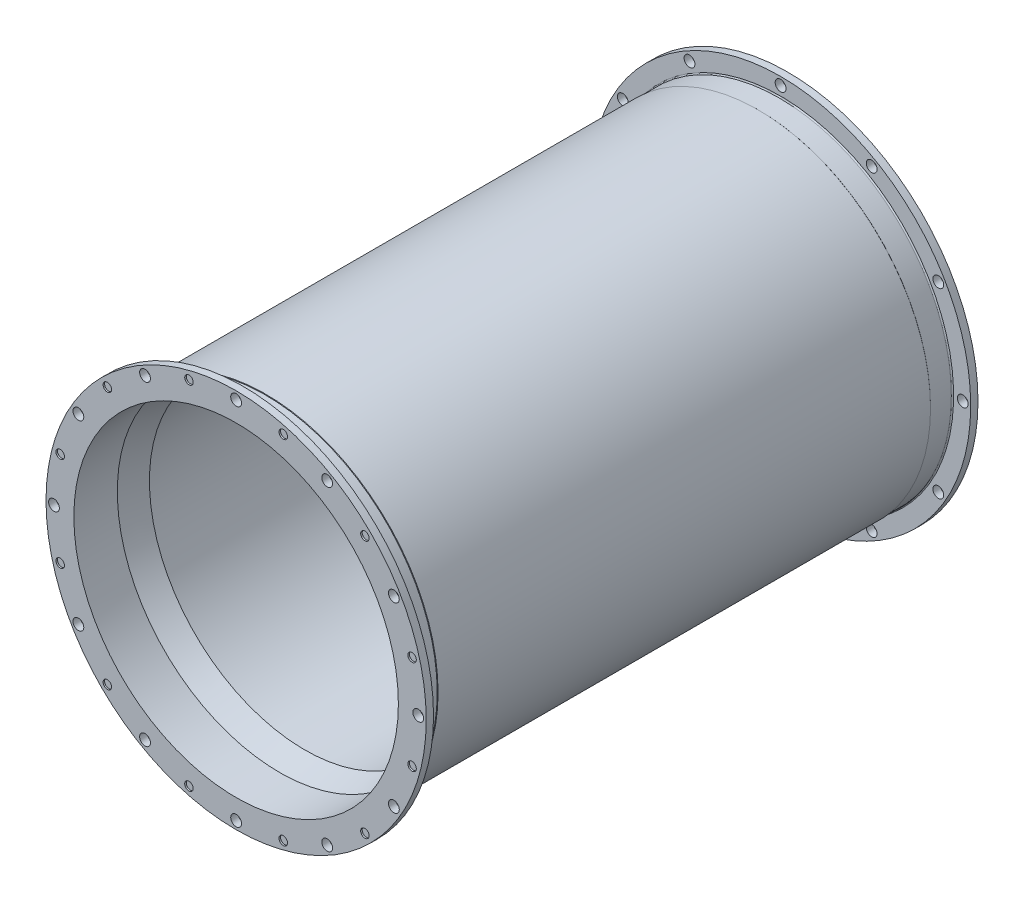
ISO-10303-21;
HEADER;
FILE_DESCRIPTION(('STEP AP214'),'2;1');
FILE_NAME('part.step','',(''),(''),'','','');
FILE_SCHEMA(('AUTOMOTIVE_DESIGN { 1 0 10303 214 1 1 1 1 }'));
ENDSEC;
DATA;
#1=APPLICATION_CONTEXT('core data for automotive mechanical design processes');
#2=APPLICATION_PROTOCOL_DEFINITION('international standard','automotive_design',2000,#1);
#3=PRODUCT_CONTEXT('',#1,'mechanical');
#4=PRODUCT('Part','Part','',(#3));
#5=PRODUCT_RELATED_PRODUCT_CATEGORY('part','',(#4));
#6=PRODUCT_DEFINITION_FORMATION('','',#4);
#7=PRODUCT_DEFINITION_CONTEXT('part definition',#1,'design');
#8=PRODUCT_DEFINITION('design','',#6,#7);
#9=PRODUCT_DEFINITION_SHAPE('','',#8);
#10=(LENGTH_UNIT() NAMED_UNIT(*) SI_UNIT(.MILLI.,.METRE.));
#11=(NAMED_UNIT(*) PLANE_ANGLE_UNIT() SI_UNIT($,.RADIAN.));
#12=(NAMED_UNIT(*) SI_UNIT($,.STERADIAN.) SOLID_ANGLE_UNIT());
#13=UNCERTAINTY_MEASURE_WITH_UNIT(LENGTH_MEASURE(1.E-05),#10,'distance_accuracy_value','');
#14=(GEOMETRIC_REPRESENTATION_CONTEXT(3) GLOBAL_UNCERTAINTY_ASSIGNED_CONTEXT((#13)) GLOBAL_UNIT_ASSIGNED_CONTEXT((#10,
#11,#12)) REPRESENTATION_CONTEXT('',''));
#15=CARTESIAN_POINT('',(0.,0.,0.));
#16=DIRECTION('',(0.,0.,1.));
#17=DIRECTION('',(1.,0.,0.));
#18=AXIS2_PLACEMENT_3D('',#15,#16,#17);
#19=CARTESIAN_POINT('',(-85.0520057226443,-85.0520057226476,-181.1655));
#20=DIRECTION('',(0.,0.,-1.));
#21=DIRECTION('',(0.,-1.,0.));
#22=AXIS2_PLACEMENT_3D('',#19,#20,#21);
#23=PLANE('',#22);
#24=CARTESIAN_POINT('',(-85.0520057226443,-85.0520057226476,-181.1655));
#25=DIRECTION('',(0.,0.,-1.));
#26=DIRECTION('',(-0.866025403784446,0.499999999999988,0.));
#27=AXIS2_PLACEMENT_3D('',#24,#25,#26);
#28=CIRCLE('',#27,2.809875);
#29=CARTESIAN_POINT('',(-87.4854288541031,-83.6470682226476,-181.1655));
#30=VERTEX_POINT('',#29);
#31=EDGE_CURVE('E212',#30,#30,#28,.T.);
#32=ORIENTED_EDGE('',*,*,#31,.T.);
#33=EDGE_LOOP('',(#32));
#34=FACE_BOUND('',#33,.T.);
#35=ADVANCED_FACE('F18',(#34),#23,.T.);
#36=CARTESIAN_POINT('',(-116.183200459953,-31.13119473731,-181.1655));
#37=DIRECTION('',(0.,0.,-1.));
#38=DIRECTION('',(0.,-1.,0.));
#39=AXIS2_PLACEMENT_3D('',#36,#37,#38);
#40=PLANE('',#39);
#41=CARTESIAN_POINT('',(-116.183200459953,-31.13119473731,-181.1655));
#42=DIRECTION('',(0.,0.,-1.));
#43=DIRECTION('',(-0.500000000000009,0.866025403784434,0.));
#44=AXIS2_PLACEMENT_3D('',#41,#42,#43);
#45=CIRCLE('',#44,2.809875);
#46=CARTESIAN_POINT('',(-117.588137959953,-28.6977716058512,-181.1655));
#47=VERTEX_POINT('',#46);
#48=EDGE_CURVE('E328',#47,#47,#45,.T.);
#49=ORIENTED_EDGE('',*,*,#48,.T.);
#50=EDGE_LOOP('',(#49));
#51=FACE_BOUND('',#50,.T.);
#52=ADVANCED_FACE('F492',(#51),#40,.T.);
#53=CARTESIAN_POINT('',(-116.183200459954,31.1311947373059,-181.1655));
#54=DIRECTION('',(0.,0.,-1.));
#55=DIRECTION('',(0.,-1.,0.));
#56=AXIS2_PLACEMENT_3D('',#53,#54,#55);
#57=PLANE('',#56);
#58=CARTESIAN_POINT('',(-116.183200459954,31.1311947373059,-181.1655));
#59=DIRECTION('',(0.,0.,-1.));
#60=DIRECTION('',(0.,1.,0.));
#61=AXIS2_PLACEMENT_3D('',#58,#59,#60);
#62=CIRCLE('',#61,2.809875);
#63=CARTESIAN_POINT('',(-116.183200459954,33.9410697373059,-181.1655));
#64=VERTEX_POINT('',#63);
#65=EDGE_CURVE('E211',#64,#64,#62,.T.);
#66=ORIENTED_EDGE('',*,*,#65,.T.);
#67=EDGE_LOOP('',(#66));
#68=FACE_BOUND('',#67,.T.);
#69=ADVANCED_FACE('F496',(#68),#57,.T.);
#70=CARTESIAN_POINT('',(-85.0520057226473,85.0520057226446,-181.1655));
#71=DIRECTION('',(0.,0.,-1.));
#72=DIRECTION('',(0.,-1.,0.));
#73=AXIS2_PLACEMENT_3D('',#70,#71,#72);
#74=PLANE('',#73);
#75=CARTESIAN_POINT('',(-85.0520057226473,85.0520057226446,-181.1655));
#76=DIRECTION('',(0.,0.,-1.));
#77=DIRECTION('',(0.499999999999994,0.866025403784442,0.));
#78=AXIS2_PLACEMENT_3D('',#75,#76,#77);
#79=CIRCLE('',#78,2.809875);
#80=CARTESIAN_POINT('',(-83.6470682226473,87.4854288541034,-181.1655));
#81=VERTEX_POINT('',#80);
#82=EDGE_CURVE('E186',#81,#81,#79,.T.);
#83=ORIENTED_EDGE('',*,*,#82,.T.);
#84=EDGE_LOOP('',(#83));
#85=FACE_BOUND('',#84,.T.);
#86=ADVANCED_FACE('F800',(#85),#74,.T.);
#87=CARTESIAN_POINT('',(-31.1311947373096,116.183200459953,-181.1655));
#88=DIRECTION('',(0.,0.,-1.));
#89=DIRECTION('',(0.,-1.,0.));
#90=AXIS2_PLACEMENT_3D('',#87,#88,#89);
#91=PLANE('',#90);
#92=CARTESIAN_POINT('',(-31.1311947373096,116.183200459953,-181.1655));
#93=DIRECTION('',(0.,0.,-1.));
#94=DIRECTION('',(0.866025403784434,0.500000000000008,0.));
#95=AXIS2_PLACEMENT_3D('',#92,#93,#94);
#96=CIRCLE('',#95,2.809875);
#97=CARTESIAN_POINT('',(-28.6977716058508,117.588137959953,-181.1655));
#98=VERTEX_POINT('',#97);
#99=EDGE_CURVE('E194',#98,#98,#96,.T.);
#100=ORIENTED_EDGE('',*,*,#99,.T.);
#101=EDGE_LOOP('',(#100));
#102=FACE_BOUND('',#101,.T.);
#103=ADVANCED_FACE('F796',(#102),#91,.T.);
#104=CARTESIAN_POINT('',(31.1311947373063,116.183200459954,-181.1655));
#105=DIRECTION('',(0.,0.,-1.));
#106=DIRECTION('',(0.,-1.,0.));
#107=AXIS2_PLACEMENT_3D('',#104,#105,#106);
#108=PLANE('',#107);
#109=CARTESIAN_POINT('',(31.1311947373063,116.183200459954,-181.1655));
#110=DIRECTION('',(0.,0.,-1.));
#111=DIRECTION('',(1.,0.,0.));
#112=AXIS2_PLACEMENT_3D('',#109,#110,#111);
#113=CIRCLE('',#112,2.809875);
#114=CARTESIAN_POINT('',(33.9410697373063,116.183200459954,-181.1655));
#115=VERTEX_POINT('',#114);
#116=EDGE_CURVE('E1513',#115,#115,#113,.T.);
#117=ORIENTED_EDGE('',*,*,#116,.T.);
#118=EDGE_LOOP('',(#117));
#119=FACE_BOUND('',#118,.T.);
#120=ADVANCED_FACE('F792',(#119),#108,.T.);
#121=CARTESIAN_POINT('',(85.0520057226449,85.052005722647,-181.1655));
#122=DIRECTION('',(0.,0.,-1.));
#123=DIRECTION('',(0.,-1.,0.));
#124=AXIS2_PLACEMENT_3D('',#121,#122,#123);
#125=PLANE('',#124);
#126=CARTESIAN_POINT('',(85.0520057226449,85.052005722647,-181.1655));
#127=DIRECTION('',(0.,0.,-1.));
#128=DIRECTION('',(0.866025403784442,-0.499999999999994,0.));
#129=AXIS2_PLACEMENT_3D('',#126,#127,#128);
#130=CIRCLE('',#129,2.809875);
#131=CARTESIAN_POINT('',(87.4854288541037,83.647068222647,-181.1655));
#132=VERTEX_POINT('',#131);
#133=EDGE_CURVE('E101',#132,#132,#130,.T.);
#134=ORIENTED_EDGE('',*,*,#133,.T.);
#135=EDGE_LOOP('',(#134));
#136=FACE_BOUND('',#135,.T.);
#137=ADVANCED_FACE('F788',(#136),#125,.T.);
#138=CARTESIAN_POINT('',(116.183200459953,31.1311947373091,-181.1655));
#139=DIRECTION('',(0.,0.,-1.));
#140=DIRECTION('',(0.,-1.,0.));
#141=AXIS2_PLACEMENT_3D('',#138,#139,#140);
#142=PLANE('',#141);
#143=CARTESIAN_POINT('',(116.183200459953,31.1311947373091,-181.1655));
#144=DIRECTION('',(0.,0.,-1.));
#145=DIRECTION('',(0.5,-0.866025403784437,0.));
#146=AXIS2_PLACEMENT_3D('',#143,#144,#145);
#147=CIRCLE('',#146,2.809875);
#148=CARTESIAN_POINT('',(117.588137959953,28.6977716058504,-181.1655));
#149=VERTEX_POINT('',#148);
#150=EDGE_CURVE('E386',#149,#149,#147,.T.);
#151=ORIENTED_EDGE('',*,*,#150,.T.);
#152=EDGE_LOOP('',(#151));
#153=FACE_BOUND('',#152,.T.);
#154=ADVANCED_FACE('F781',(#153),#142,.T.);
#155=CARTESIAN_POINT('',(116.183200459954,-31.1311947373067,-181.1655));
#156=DIRECTION('',(0.,0.,-1.));
#157=DIRECTION('',(0.,-1.,0.));
#158=AXIS2_PLACEMENT_3D('',#155,#156,#157);
#159=PLANE('',#158);
#160=CARTESIAN_POINT('',(116.183200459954,-31.1311947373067,-181.1655));
#161=DIRECTION('',(0.,0.,-1.));
#162=DIRECTION('',(0.,-1.,0.));
#163=AXIS2_PLACEMENT_3D('',#160,#161,#162);
#164=CIRCLE('',#163,2.809875);
#165=CARTESIAN_POINT('',(116.183200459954,-33.9410697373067,-181.1655));
#166=VERTEX_POINT('',#165);
#167=EDGE_CURVE('E373',#166,#166,#164,.T.);
#168=ORIENTED_EDGE('',*,*,#167,.T.);
#169=EDGE_LOOP('',(#168));
#170=FACE_BOUND('',#169,.T.);
#171=ADVANCED_FACE('F778',(#170),#159,.T.);
#172=CARTESIAN_POINT('',(85.0520057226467,-85.0520057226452,-181.1655));
#173=DIRECTION('',(0.,0.,-1.));
#174=DIRECTION('',(0.,-1.,0.));
#175=AXIS2_PLACEMENT_3D('',#172,#173,#174);
#176=PLANE('',#175);
#177=CARTESIAN_POINT('',(85.0520057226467,-85.0520057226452,-181.1655));
#178=DIRECTION('',(0.,0.,-1.));
#179=DIRECTION('',(-0.5,-0.86602540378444,0.));
#180=AXIS2_PLACEMENT_3D('',#177,#178,#179);
#181=CIRCLE('',#180,2.809875);
#182=CARTESIAN_POINT('',(83.6470682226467,-87.485428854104,-181.1655));
#183=VERTEX_POINT('',#182);
#184=EDGE_CURVE('E118',#183,#183,#181,.T.);
#185=ORIENTED_EDGE('',*,*,#184,.T.);
#186=EDGE_LOOP('',(#185));
#187=FACE_BOUND('',#186,.T.);
#188=ADVANCED_FACE('F776',(#187),#176,.T.);
#189=CARTESIAN_POINT('',(31.1311947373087,-116.183200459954,-181.1655));
#190=DIRECTION('',(0.,0.,-1.));
#191=DIRECTION('',(0.,-1.,0.));
#192=AXIS2_PLACEMENT_3D('',#189,#190,#191);
#193=PLANE('',#192);
#194=CARTESIAN_POINT('',(31.1311947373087,-116.183200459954,-181.1655));
#195=DIRECTION('',(0.,0.,-1.));
#196=DIRECTION('',(-0.866025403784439,-0.5,0.));
#197=AXIS2_PLACEMENT_3D('',#194,#195,#196);
#198=CIRCLE('',#197,2.809875);
#199=CARTESIAN_POINT('',(28.69777160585,-117.588137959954,-181.1655));
#200=VERTEX_POINT('',#199);
#201=EDGE_CURVE('E100',#200,#200,#198,.T.);
#202=ORIENTED_EDGE('',*,*,#201,.T.);
#203=EDGE_LOOP('',(#202));
#204=FACE_BOUND('',#203,.T.);
#205=ADVANCED_FACE('F772',(#204),#193,.T.);
#206=CARTESIAN_POINT('',(-31.1311947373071,-116.183200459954,-181.1655));
#207=DIRECTION('',(0.,0.,-1.));
#208=DIRECTION('',(0.,-1.,0.));
#209=AXIS2_PLACEMENT_3D('',#206,#207,#208);
#210=PLANE('',#209);
#211=CARTESIAN_POINT('',(-31.1311947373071,-116.183200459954,-181.1655));
#212=DIRECTION('',(0.,0.,-1.));
#213=DIRECTION('',(-1.,0.,0.));
#214=AXIS2_PLACEMENT_3D('',#211,#212,#213);
#215=CIRCLE('',#214,2.809875);
#216=CARTESIAN_POINT('',(-33.9410697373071,-116.183200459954,-181.1655));
#217=VERTEX_POINT('',#216);
#218=EDGE_CURVE('E99',#217,#217,#215,.T.);
#219=ORIENTED_EDGE('',*,*,#218,.T.);
#220=EDGE_LOOP('',(#219));
#221=FACE_BOUND('',#220,.T.);
#222=ADVANCED_FACE('F745',(#221),#210,.T.);
#223=CARTESIAN_POINT('',(-31.1311947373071,-116.183200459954,181.1655));
#224=DIRECTION('',(0.,0.,1.));
#225=DIRECTION('',(1.,0.,0.));
#226=AXIS2_PLACEMENT_3D('',#223,#224,#225);
#227=PLANE('',#226);
#228=CARTESIAN_POINT('',(-31.1311947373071,-116.183200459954,181.1655));
#229=DIRECTION('',(0.,0.,1.));
#230=DIRECTION('',(0.866025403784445,-0.499999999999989,0.));
#231=AXIS2_PLACEMENT_3D('',#228,#229,#230);
#232=CIRCLE('',#231,2.809875);
#233=CARTESIAN_POINT('',(-28.6977716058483,-117.588137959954,181.1655));
#234=VERTEX_POINT('',#233);
#235=EDGE_CURVE('E268',#234,#234,#232,.T.);
#236=ORIENTED_EDGE('',*,*,#235,.T.);
#237=EDGE_LOOP('',(#236));
#238=FACE_BOUND('',#237,.T.);
#239=ADVANCED_FACE('F741',(#238),#227,.T.);
#240=CARTESIAN_POINT('',(-85.0520057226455,-85.0520057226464,181.1655));
#241=DIRECTION('',(0.,0.,1.));
#242=DIRECTION('',(1.,0.,0.));
#243=AXIS2_PLACEMENT_3D('',#240,#241,#242);
#244=PLANE('',#243);
#245=CARTESIAN_POINT('',(-85.0520057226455,-85.0520057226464,181.1655));
#246=DIRECTION('',(0.,0.,1.));
#247=DIRECTION('',(0.500000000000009,-0.866025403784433,0.));
#248=AXIS2_PLACEMENT_3D('',#245,#246,#247);
#249=CIRCLE('',#248,2.809875);
#250=CARTESIAN_POINT('',(-83.6470682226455,-87.4854288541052,181.1655));
#251=VERTEX_POINT('',#250);
#252=EDGE_CURVE('E379',#251,#251,#249,.T.);
#253=ORIENTED_EDGE('',*,*,#252,.T.);
#254=EDGE_LOOP('',(#253));
#255=FACE_BOUND('',#254,.T.);
#256=ADVANCED_FACE('F744',(#255),#244,.T.);
#257=CARTESIAN_POINT('',(-116.183200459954,-31.1311947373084,181.1655));
#258=DIRECTION('',(0.,0.,1.));
#259=DIRECTION('',(1.,0.,0.));
#260=AXIS2_PLACEMENT_3D('',#257,#258,#259);
#261=PLANE('',#260);
#262=CARTESIAN_POINT('',(-116.183200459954,-31.1311947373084,181.1655));
#263=DIRECTION('',(0.,0.,1.));
#264=DIRECTION('',(0.,-1.,0.));
#265=AXIS2_PLACEMENT_3D('',#262,#263,#264);
#266=CIRCLE('',#265,2.809875);
#267=CARTESIAN_POINT('',(-116.183200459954,-33.9410697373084,181.1655));
#268=VERTEX_POINT('',#267);
#269=EDGE_CURVE('E167',#268,#268,#266,.T.);
#270=ORIENTED_EDGE('',*,*,#269,.T.);
#271=EDGE_LOOP('',(#270));
#272=FACE_BOUND('',#271,.T.);
#273=ADVANCED_FACE('F705',(#272),#261,.T.);
#274=CARTESIAN_POINT('',(-116.183200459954,31.1311947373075,181.1655));
#275=DIRECTION('',(0.,0.,1.));
#276=DIRECTION('',(1.,0.,0.));
#277=AXIS2_PLACEMENT_3D('',#274,#275,#276);
#278=PLANE('',#277);
#279=CARTESIAN_POINT('',(-116.183200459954,31.1311947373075,181.1655));
#280=DIRECTION('',(0.,0.,1.));
#281=DIRECTION('',(-0.499999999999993,-0.866025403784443,0.));
#282=AXIS2_PLACEMENT_3D('',#279,#280,#281);
#283=CIRCLE('',#282,2.809875);
#284=CARTESIAN_POINT('',(-117.588137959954,28.6977716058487,181.1655));
#285=VERTEX_POINT('',#284);
#286=EDGE_CURVE('E166',#285,#285,#283,.T.);
#287=ORIENTED_EDGE('',*,*,#286,.T.);
#288=EDGE_LOOP('',(#287));
#289=FACE_BOUND('',#288,.T.);
#290=ADVANCED_FACE('F701',(#289),#278,.T.);
#291=CARTESIAN_POINT('',(-85.0520057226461,85.0520057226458,181.1655));
#292=DIRECTION('',(0.,0.,1.));
#293=DIRECTION('',(1.,0.,0.));
#294=AXIS2_PLACEMENT_3D('',#291,#292,#293);
#295=PLANE('',#294);
#296=CARTESIAN_POINT('',(-85.0520057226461,85.0520057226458,181.1655));
#297=DIRECTION('',(0.,0.,1.));
#298=DIRECTION('',(-0.866025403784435,-0.500000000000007,0.));
#299=AXIS2_PLACEMENT_3D('',#296,#297,#298);
#300=CIRCLE('',#299,2.809875);
#301=CARTESIAN_POINT('',(-87.4854288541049,83.6470682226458,181.1655));
#302=VERTEX_POINT('',#301);
#303=EDGE_CURVE('E168',#302,#302,#300,.T.);
#304=ORIENTED_EDGE('',*,*,#303,.T.);
#305=EDGE_LOOP('',(#304));
#306=FACE_BOUND('',#305,.T.);
#307=ADVANCED_FACE('F704',(#306),#295,.T.);
#308=CARTESIAN_POINT('',(-31.1311947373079,116.183200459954,181.1655));
#309=DIRECTION('',(0.,0.,1.));
#310=DIRECTION('',(1.,0.,0.));
#311=AXIS2_PLACEMENT_3D('',#308,#309,#310);
#312=PLANE('',#311);
#313=CARTESIAN_POINT('',(-31.1311947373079,116.183200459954,181.1655));
#314=DIRECTION('',(0.,0.,1.));
#315=DIRECTION('',(-1.,0.,0.));
#316=AXIS2_PLACEMENT_3D('',#313,#314,#315);
#317=CIRCLE('',#316,2.809875);
#318=CARTESIAN_POINT('',(-33.9410697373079,116.183200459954,181.1655));
#319=VERTEX_POINT('',#318);
#320=EDGE_CURVE('E137',#319,#319,#317,.T.);
#321=ORIENTED_EDGE('',*,*,#320,.T.);
#322=EDGE_LOOP('',(#321));
#323=FACE_BOUND('',#322,.T.);
#324=ADVANCED_FACE('F714',(#323),#312,.T.);
#325=CARTESIAN_POINT('',(31.1311947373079,116.183200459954,181.1655));
#326=DIRECTION('',(0.,0.,1.));
#327=DIRECTION('',(1.,0.,0.));
#328=AXIS2_PLACEMENT_3D('',#325,#326,#327);
#329=PLANE('',#328);
#330=CARTESIAN_POINT('',(31.1311947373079,116.183200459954,181.1655));
#331=DIRECTION('',(0.,0.,1.));
#332=DIRECTION('',(-0.866025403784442,0.499999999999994,0.));
#333=AXIS2_PLACEMENT_3D('',#330,#331,#332);
#334=CIRCLE('',#333,2.809875);
#335=CARTESIAN_POINT('',(28.6977716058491,117.588137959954,181.1655));
#336=VERTEX_POINT('',#335);
#337=EDGE_CURVE('E152',#336,#336,#334,.T.);
#338=ORIENTED_EDGE('',*,*,#337,.T.);
#339=EDGE_LOOP('',(#338));
#340=FACE_BOUND('',#339,.T.);
#341=ADVANCED_FACE('F710',(#340),#329,.T.);
#342=CARTESIAN_POINT('',(85.0520057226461,85.0520057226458,181.1655));
#343=DIRECTION('',(0.,0.,1.));
#344=DIRECTION('',(1.,0.,0.));
#345=AXIS2_PLACEMENT_3D('',#342,#343,#344);
#346=PLANE('',#345);
#347=CARTESIAN_POINT('',(85.0520057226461,85.0520057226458,181.1655));
#348=DIRECTION('',(0.,0.,1.));
#349=DIRECTION('',(-0.5,0.866025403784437,0.));
#350=AXIS2_PLACEMENT_3D('',#347,#348,#349);
#351=CIRCLE('',#350,2.809875);
#352=CARTESIAN_POINT('',(83.6470682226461,87.4854288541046,181.1655));
#353=VERTEX_POINT('',#352);
#354=EDGE_CURVE('E535',#353,#353,#351,.T.);
#355=ORIENTED_EDGE('',*,*,#354,.T.);
#356=EDGE_LOOP('',(#355));
#357=FACE_BOUND('',#356,.T.);
#358=ADVANCED_FACE('F713',(#357),#346,.T.);
#359=CARTESIAN_POINT('',(116.183200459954,31.1311947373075,181.1655));
#360=DIRECTION('',(0.,0.,1.));
#361=DIRECTION('',(1.,0.,0.));
#362=AXIS2_PLACEMENT_3D('',#359,#360,#361);
#363=PLANE('',#362);
#364=CARTESIAN_POINT('',(116.183200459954,31.1311947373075,181.1655));
#365=DIRECTION('',(0.,0.,1.));
#366=DIRECTION('',(0.,1.,0.));
#367=AXIS2_PLACEMENT_3D('',#364,#365,#366);
#368=CIRCLE('',#367,2.809875);
#369=CARTESIAN_POINT('',(116.183200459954,33.9410697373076,181.1655));
#370=VERTEX_POINT('',#369);
#371=EDGE_CURVE('E534',#370,#370,#368,.T.);
#372=ORIENTED_EDGE('',*,*,#371,.T.);
#373=EDGE_LOOP('',(#372));
#374=FACE_BOUND('',#373,.T.);
#375=ADVANCED_FACE('F753',(#374),#363,.T.);
#376=CARTESIAN_POINT('',(116.183200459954,-31.1311947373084,181.1655));
#377=DIRECTION('',(0.,0.,1.));
#378=DIRECTION('',(1.,0.,0.));
#379=AXIS2_PLACEMENT_3D('',#376,#377,#378);
#380=PLANE('',#379);
#381=CARTESIAN_POINT('',(116.183200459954,-31.1311947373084,181.1655));
#382=DIRECTION('',(0.,0.,1.));
#383=DIRECTION('',(0.5,0.866025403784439,0.));
#384=AXIS2_PLACEMENT_3D('',#381,#382,#383);
#385=CIRCLE('',#384,2.809875);
#386=CARTESIAN_POINT('',(117.588137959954,-28.6977716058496,181.1655));
#387=VERTEX_POINT('',#386);
#388=EDGE_CURVE('E547',#387,#387,#385,.T.);
#389=ORIENTED_EDGE('',*,*,#388,.T.);
#390=EDGE_LOOP('',(#389));
#391=FACE_BOUND('',#390,.T.);
#392=ADVANCED_FACE('F749',(#391),#380,.T.);
#393=CARTESIAN_POINT('',(85.0520057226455,-85.0520057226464,181.1655));
#394=DIRECTION('',(0.,0.,1.));
#395=DIRECTION('',(1.,0.,0.));
#396=AXIS2_PLACEMENT_3D('',#393,#394,#395);
#397=PLANE('',#396);
#398=CARTESIAN_POINT('',(85.0520057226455,-85.0520057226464,181.1655));
#399=DIRECTION('',(0.,0.,1.));
#400=DIRECTION('',(0.866025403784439,0.5,0.));
#401=AXIS2_PLACEMENT_3D('',#398,#399,#400);
#402=CIRCLE('',#401,2.809875);
#403=CARTESIAN_POINT('',(87.4854288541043,-83.6470682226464,181.1655));
#404=VERTEX_POINT('',#403);
#405=EDGE_CURVE('E557',#404,#404,#402,.T.);
#406=ORIENTED_EDGE('',*,*,#405,.T.);
#407=EDGE_LOOP('',(#406));
#408=FACE_BOUND('',#407,.T.);
#409=ADVANCED_FACE('F738',(#408),#397,.T.);
#410=CARTESIAN_POINT('',(31.1311947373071,-116.183200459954,181.1655));
#411=DIRECTION('',(0.,0.,1.));
#412=DIRECTION('',(1.,0.,0.));
#413=AXIS2_PLACEMENT_3D('',#410,#411,#412);
#414=PLANE('',#413);
#415=CARTESIAN_POINT('',(31.1311947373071,-116.183200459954,181.1655));
#416=DIRECTION('',(0.,0.,1.));
#417=DIRECTION('',(1.,0.,0.));
#418=AXIS2_PLACEMENT_3D('',#415,#416,#417);
#419=CIRCLE('',#418,2.809875);
#420=CARTESIAN_POINT('',(33.9410697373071,-116.183200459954,181.1655));
#421=VERTEX_POINT('',#420);
#422=EDGE_CURVE('E568',#421,#421,#419,.T.);
#423=ORIENTED_EDGE('',*,*,#422,.T.);
#424=EDGE_LOOP('',(#423));
#425=FACE_BOUND('',#424,.T.);
#426=ADVANCED_FACE('F736',(#425),#414,.T.);
#427=CARTESIAN_POINT('',(0.,125.54204,177.3555));
#428=DIRECTION('',(0.,0.,1.));
#429=DIRECTION('',(1.,0.,0.));
#430=AXIS2_PLACEMENT_3D('',#427,#428,#429);
#431=PLANE('',#430);
#432=CARTESIAN_POINT('',(0.,0.,177.3555));
#433=DIRECTION('',(0.,0.,1.));
#434=DIRECTION('',(1.,0.,0.));
#435=AXIS2_PLACEMENT_3D('',#432,#433,#434);
#436=CIRCLE('',#435,114.26063);
#437=CARTESIAN_POINT('',(114.26063,0.,177.3555));
#438=VERTEX_POINT('',#437);
#439=EDGE_CURVE('E429',#438,#438,#436,.T.);
#440=ORIENTED_EDGE('',*,*,#439,.T.);
#441=EDGE_LOOP('',(#440));
#442=FACE_BOUND('',#441,.T.);
#443=CARTESIAN_POINT('',(0.,-120.2817,177.3555));
#444=DIRECTION('',(0.,0.,1.));
#445=DIRECTION('',(1.,0.,0.));
#446=AXIS2_PLACEMENT_3D('',#443,#444,#445);
#447=CIRCLE('',#446,3.5687);
#448=CARTESIAN_POINT('',(3.5687,-120.2817,177.3555));
#449=VERTEX_POINT('',#448);
#450=EDGE_CURVE('E305',#449,#449,#447,.T.);
#451=ORIENTED_EDGE('',*,*,#450,.T.);
#452=EDGE_LOOP('',(#451));
#453=FACE_BOUND('',#452,.T.);
#454=CARTESIAN_POINT('',(60.14085,-104.167007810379,177.3555));
#455=DIRECTION('',(0.,0.,1.));
#456=DIRECTION('',(0.866025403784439,0.5,0.));
#457=AXIS2_PLACEMENT_3D('',#454,#455,#456);
#458=CIRCLE('',#457,3.5687);
#459=CARTESIAN_POINT('',(63.2314348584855,-102.382657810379,177.3555));
#460=VERTEX_POINT('',#459);
#461=EDGE_CURVE('E669',#460,#460,#458,.T.);
#462=ORIENTED_EDGE('',*,*,#461,.T.);
#463=EDGE_LOOP('',(#462));
#464=FACE_BOUND('',#463,.T.);
#465=CARTESIAN_POINT('',(104.167007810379,-60.14085,177.3555));
#466=DIRECTION('',(0.,0.,1.));
#467=DIRECTION('',(0.5,0.86602540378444,0.));
#468=AXIS2_PLACEMENT_3D('',#465,#466,#467);
#469=CIRCLE('',#468,3.5687);
#470=CARTESIAN_POINT('',(105.951357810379,-57.0502651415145,177.3555));
#471=VERTEX_POINT('',#470);
#472=EDGE_CURVE('E661',#471,#471,#469,.T.);
#473=ORIENTED_EDGE('',*,*,#472,.T.);
#474=EDGE_LOOP('',(#473));
#475=FACE_BOUND('',#474,.T.);
#476=CARTESIAN_POINT('',(120.2817,4.19961310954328E-13,177.3555));
#477=DIRECTION('',(0.,0.,1.));
#478=DIRECTION('',(0.,1.,0.));
#479=AXIS2_PLACEMENT_3D('',#476,#477,#478);
#480=CIRCLE('',#479,3.5687);
#481=CARTESIAN_POINT('',(120.2817,3.56870000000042,177.3555));
#482=VERTEX_POINT('',#481);
#483=EDGE_CURVE('E662',#482,#482,#480,.T.);
#484=ORIENTED_EDGE('',*,*,#483,.T.);
#485=EDGE_LOOP('',(#484));
#486=FACE_BOUND('',#485,.T.);
#487=CARTESIAN_POINT('',(104.167007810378,60.14085,177.3555));
#488=DIRECTION('',(0.,0.,1.));
#489=DIRECTION('',(-0.5,0.866025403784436,0.));
#490=AXIS2_PLACEMENT_3D('',#487,#488,#489);
#491=CIRCLE('',#490,3.5687);
#492=CARTESIAN_POINT('',(102.382657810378,63.2314348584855,177.3555));
#493=VERTEX_POINT('',#492);
#494=EDGE_CURVE('E647',#493,#493,#491,.T.);
#495=ORIENTED_EDGE('',*,*,#494,.T.);
#496=EDGE_LOOP('',(#495));
#497=FACE_BOUND('',#496,.T.);
#498=CARTESIAN_POINT('',(60.14085,104.167007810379,177.3555));
#499=DIRECTION('',(0.,0.,1.));
#500=DIRECTION('',(-0.866025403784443,0.499999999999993,0.));
#501=AXIS2_PLACEMENT_3D('',#498,#499,#500);
#502=CIRCLE('',#501,3.5687);
#503=CARTESIAN_POINT('',(57.0502651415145,105.951357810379,177.3555));
#504=VERTEX_POINT('',#503);
#505=EDGE_CURVE('E637',#504,#504,#502,.T.);
#506=ORIENTED_EDGE('',*,*,#505,.T.);
#507=EDGE_LOOP('',(#506));
#508=FACE_BOUND('',#507,.T.);
#509=CARTESIAN_POINT('',(-8.39922621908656E-13,120.2817,177.3555));
#510=DIRECTION('',(0.,0.,1.));
#511=DIRECTION('',(-1.,0.,0.));
#512=AXIS2_PLACEMENT_3D('',#509,#510,#511);
#513=CIRCLE('',#512,3.5687);
#514=CARTESIAN_POINT('',(-3.56870000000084,120.2817,177.3555));
#515=VERTEX_POINT('',#514);
#516=EDGE_CURVE('E625',#515,#515,#513,.T.);
#517=ORIENTED_EDGE('',*,*,#516,.T.);
#518=EDGE_LOOP('',(#517));
#519=FACE_BOUND('',#518,.T.);
#520=CARTESIAN_POINT('',(-60.1408500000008,104.167007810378,177.3555));
#521=DIRECTION('',(0.,0.,1.));
#522=DIRECTION('',(-0.866025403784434,-0.500000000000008,0.));
#523=AXIS2_PLACEMENT_3D('',#520,#521,#522);
#524=CIRCLE('',#523,3.5687);
#525=CARTESIAN_POINT('',(-63.2314348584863,102.382657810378,177.3555));
#526=VERTEX_POINT('',#525);
#527=EDGE_CURVE('E613',#526,#526,#524,.T.);
#528=ORIENTED_EDGE('',*,*,#527,.T.);
#529=EDGE_LOOP('',(#528));
#530=FACE_BOUND('',#529,.T.);
#531=CARTESIAN_POINT('',(-104.167007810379,60.140849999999,177.3555));
#532=DIRECTION('',(0.,0.,1.));
#533=DIRECTION('',(-0.499999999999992,-0.866025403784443,0.));
#534=AXIS2_PLACEMENT_3D('',#531,#532,#533);
#535=CIRCLE('',#534,3.5687);
#536=CARTESIAN_POINT('',(-105.951357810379,57.0502651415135,177.3555));
#537=VERTEX_POINT('',#536);
#538=EDGE_CURVE('E604',#537,#537,#535,.T.);
#539=ORIENTED_EDGE('',*,*,#538,.T.);
#540=EDGE_LOOP('',(#539));
#541=FACE_BOUND('',#540,.T.);
#542=CARTESIAN_POINT('',(-120.2817,-1.25988393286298E-12,177.3555));
#543=DIRECTION('',(0.,0.,1.));
#544=DIRECTION('',(0.,-1.,0.));
#545=AXIS2_PLACEMENT_3D('',#542,#543,#544);
#546=CIRCLE('',#545,3.5687);
#547=CARTESIAN_POINT('',(-120.2817,-3.56870000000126,177.3555));
#548=VERTEX_POINT('',#547);
#549=EDGE_CURVE('E592',#548,#548,#546,.T.);
#550=ORIENTED_EDGE('',*,*,#549,.T.);
#551=EDGE_LOOP('',(#550));
#552=FACE_BOUND('',#551,.T.);
#553=CARTESIAN_POINT('',(-104.167007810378,-60.1408500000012,177.3555));
#554=DIRECTION('',(0.,0.,1.));
#555=DIRECTION('',(0.500000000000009,-0.866025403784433,0.));
#556=AXIS2_PLACEMENT_3D('',#553,#554,#555);
#557=CIRCLE('',#556,3.5687);
#558=CARTESIAN_POINT('',(-102.382657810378,-63.2314348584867,177.3555));
#559=VERTEX_POINT('',#558);
#560=EDGE_CURVE('E580',#559,#559,#557,.T.);
#561=ORIENTED_EDGE('',*,*,#560,.T.);
#562=EDGE_LOOP('',(#561));
#563=FACE_BOUND('',#562,.T.);
#564=CARTESIAN_POINT('',(-60.1408499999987,-104.167007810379,177.3555));
#565=DIRECTION('',(0.,0.,1.));
#566=DIRECTION('',(0.866025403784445,-0.499999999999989,0.));
#567=AXIS2_PLACEMENT_3D('',#564,#565,#566);
#568=CIRCLE('',#567,3.5687);
#569=CARTESIAN_POINT('',(-57.0502651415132,-105.951357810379,177.3555));
#570=VERTEX_POINT('',#569);
#571=EDGE_CURVE('E87',#570,#570,#568,.T.);
#572=ORIENTED_EDGE('',*,*,#571,.T.);
#573=EDGE_LOOP('',(#572));
#574=FACE_BOUND('',#573,.T.);
#575=CARTESIAN_POINT('',(0.,0.,177.3555));
#576=DIRECTION('',(0.,0.,1.));
#577=DIRECTION('',(1.,0.,0.));
#578=AXIS2_PLACEMENT_3D('',#575,#576,#577);
#579=CIRCLE('',#578,125.54204);
#580=CARTESIAN_POINT('',(125.54204,0.,177.3555));
#581=VERTEX_POINT('',#580);
#582=EDGE_CURVE('E413',#581,#581,#579,.T.);
#583=ORIENTED_EDGE('',*,*,#582,.F.);
#584=EDGE_LOOP('',(#583));
#585=FACE_BOUND('',#584,.T.);
#586=ADVANCED_FACE('F287',(#442,#453,#464,#475,#486,#497,#508,#519,#530,#541,#552,#563,#574,
#585),#431,.F.);
#587=CARTESIAN_POINT('',(0.,125.54204,-177.3555));
#588=DIRECTION('',(0.,0.,-1.));
#589=DIRECTION('',(0.,-1.,0.));
#590=AXIS2_PLACEMENT_3D('',#587,#588,#589);
#591=PLANE('',#590);
#592=CARTESIAN_POINT('',(-60.1408499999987,-104.167007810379,-177.3555));
#593=DIRECTION('',(0.,0.,1.));
#594=DIRECTION('',(0.866025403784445,-0.499999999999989,0.));
#595=AXIS2_PLACEMENT_3D('',#592,#593,#594);
#596=CIRCLE('',#595,3.5687);
#597=CARTESIAN_POINT('',(-57.0502651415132,-105.951357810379,-177.3555));
#598=VERTEX_POINT('',#597);
#599=EDGE_CURVE('E53',#598,#598,#596,.T.);
#600=ORIENTED_EDGE('',*,*,#599,.F.);
#601=EDGE_LOOP('',(#600));
#602=FACE_BOUND('',#601,.T.);
#603=CARTESIAN_POINT('',(-104.167007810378,-60.1408500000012,-177.3555));
#604=DIRECTION('',(0.,0.,1.));
#605=DIRECTION('',(0.500000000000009,-0.866025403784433,0.));
#606=AXIS2_PLACEMENT_3D('',#603,#604,#605);
#607=CIRCLE('',#606,3.5687);
#608=CARTESIAN_POINT('',(-102.382657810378,-63.2314348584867,-177.3555));
#609=VERTEX_POINT('',#608);
#610=EDGE_CURVE('E67',#609,#609,#607,.T.);
#611=ORIENTED_EDGE('',*,*,#610,.F.);
#612=EDGE_LOOP('',(#611));
#613=FACE_BOUND('',#612,.T.);
#614=CARTESIAN_POINT('',(-120.2817,-1.25988393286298E-12,-177.3555));
#615=DIRECTION('',(0.,0.,1.));
#616=DIRECTION('',(0.,-1.,0.));
#617=AXIS2_PLACEMENT_3D('',#614,#615,#616);
#618=CIRCLE('',#617,3.5687);
#619=CARTESIAN_POINT('',(-120.2817,-3.56870000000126,-177.3555));
#620=VERTEX_POINT('',#619);
#621=EDGE_CURVE('E83',#620,#620,#618,.T.);
#622=ORIENTED_EDGE('',*,*,#621,.F.);
#623=EDGE_LOOP('',(#622));
#624=FACE_BOUND('',#623,.T.);
#625=CARTESIAN_POINT('',(-104.167007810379,60.140849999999,-177.3555));
#626=DIRECTION('',(0.,0.,1.));
#627=DIRECTION('',(-0.499999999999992,-0.866025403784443,0.));
#628=AXIS2_PLACEMENT_3D('',#625,#626,#627);
#629=CIRCLE('',#628,3.5687);
#630=CARTESIAN_POINT('',(-105.951357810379,57.0502651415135,-177.3555));
#631=VERTEX_POINT('',#630);
#632=EDGE_CURVE('E340',#631,#631,#629,.T.);
#633=ORIENTED_EDGE('',*,*,#632,.F.);
#634=EDGE_LOOP('',(#633));
#635=FACE_BOUND('',#634,.T.);
#636=CARTESIAN_POINT('',(-60.1408500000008,104.167007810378,-177.3555));
#637=DIRECTION('',(0.,0.,1.));
#638=DIRECTION('',(-0.866025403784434,-0.500000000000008,0.));
#639=AXIS2_PLACEMENT_3D('',#636,#637,#638);
#640=CIRCLE('',#639,3.5687);
#641=CARTESIAN_POINT('',(-63.2314348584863,102.382657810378,-177.3555));
#642=VERTEX_POINT('',#641);
#643=EDGE_CURVE('E339',#642,#642,#640,.T.);
#644=ORIENTED_EDGE('',*,*,#643,.F.);
#645=EDGE_LOOP('',(#644));
#646=FACE_BOUND('',#645,.T.);
#647=CARTESIAN_POINT('',(-8.39922621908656E-13,120.2817,-177.3555));
#648=DIRECTION('',(0.,0.,1.));
#649=DIRECTION('',(-1.,0.,0.));
#650=AXIS2_PLACEMENT_3D('',#647,#648,#649);
#651=CIRCLE('',#650,3.5687);
#652=CARTESIAN_POINT('',(-3.56870000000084,120.2817,-177.3555));
#653=VERTEX_POINT('',#652);
#654=EDGE_CURVE('E349',#653,#653,#651,.T.);
#655=ORIENTED_EDGE('',*,*,#654,.F.);
#656=EDGE_LOOP('',(#655));
#657=FACE_BOUND('',#656,.T.);
#658=CARTESIAN_POINT('',(60.14085,104.167007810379,-177.3555));
#659=DIRECTION('',(0.,0.,1.));
#660=DIRECTION('',(-0.866025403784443,0.499999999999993,0.));
#661=AXIS2_PLACEMENT_3D('',#658,#659,#660);
#662=CIRCLE('',#661,3.5687);
#663=CARTESIAN_POINT('',(57.0502651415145,105.951357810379,-177.3555));
#664=VERTEX_POINT('',#663);
#665=EDGE_CURVE('E220',#664,#664,#662,.T.);
#666=ORIENTED_EDGE('',*,*,#665,.F.);
#667=EDGE_LOOP('',(#666));
#668=FACE_BOUND('',#667,.T.);
#669=CARTESIAN_POINT('',(104.167007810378,60.14085,-177.3555));
#670=DIRECTION('',(0.,0.,1.));
#671=DIRECTION('',(-0.5,0.866025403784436,0.));
#672=AXIS2_PLACEMENT_3D('',#669,#670,#671);
#673=CIRCLE('',#672,3.5687);
#674=CARTESIAN_POINT('',(102.382657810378,63.2314348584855,-177.3555));
#675=VERTEX_POINT('',#674);
#676=EDGE_CURVE('E219',#675,#675,#673,.T.);
#677=ORIENTED_EDGE('',*,*,#676,.F.);
#678=EDGE_LOOP('',(#677));
#679=FACE_BOUND('',#678,.T.);
#680=CARTESIAN_POINT('',(120.2817,4.19961310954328E-13,-177.3555));
#681=DIRECTION('',(0.,0.,1.));
#682=DIRECTION('',(0.,1.,0.));
#683=AXIS2_PLACEMENT_3D('',#680,#681,#682);
#684=CIRCLE('',#683,3.5687);
#685=CARTESIAN_POINT('',(120.2817,3.56870000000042,-177.3555));
#686=VERTEX_POINT('',#685);
#687=EDGE_CURVE('E238',#686,#686,#684,.T.);
#688=ORIENTED_EDGE('',*,*,#687,.F.);
#689=EDGE_LOOP('',(#688));
#690=FACE_BOUND('',#689,.T.);
#691=CARTESIAN_POINT('',(104.167007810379,-60.14085,-177.3555));
#692=DIRECTION('',(0.,0.,1.));
#693=DIRECTION('',(0.5,0.86602540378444,0.));
#694=AXIS2_PLACEMENT_3D('',#691,#692,#693);
#695=CIRCLE('',#694,3.5687);
#696=CARTESIAN_POINT('',(105.951357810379,-57.0502651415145,-177.3555));
#697=VERTEX_POINT('',#696);
#698=EDGE_CURVE('E240',#697,#697,#695,.T.);
#699=ORIENTED_EDGE('',*,*,#698,.F.);
#700=EDGE_LOOP('',(#699));
#701=FACE_BOUND('',#700,.T.);
#702=CARTESIAN_POINT('',(60.14085,-104.167007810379,-177.3555));
#703=DIRECTION('',(0.,0.,1.));
#704=DIRECTION('',(0.866025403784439,0.5,0.));
#705=AXIS2_PLACEMENT_3D('',#702,#703,#704);
#706=CIRCLE('',#705,3.5687);
#707=CARTESIAN_POINT('',(63.2314348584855,-102.382657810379,-177.3555));
#708=VERTEX_POINT('',#707);
#709=EDGE_CURVE('E254',#708,#708,#706,.T.);
#710=ORIENTED_EDGE('',*,*,#709,.F.);
#711=EDGE_LOOP('',(#710));
#712=FACE_BOUND('',#711,.T.);
#713=CARTESIAN_POINT('',(0.,-120.2817,-177.3555));
#714=DIRECTION('',(0.,0.,1.));
#715=DIRECTION('',(1.,0.,0.));
#716=AXIS2_PLACEMENT_3D('',#713,#714,#715);
#717=CIRCLE('',#716,3.5687);
#718=CARTESIAN_POINT('',(3.5687,-120.2817,-177.3555));
#719=VERTEX_POINT('',#718);
#720=EDGE_CURVE('E258',#719,#719,#717,.T.);
#721=ORIENTED_EDGE('',*,*,#720,.F.);
#722=EDGE_LOOP('',(#721));
#723=FACE_BOUND('',#722,.T.);
#724=CARTESIAN_POINT('',(0.,0.,-177.3555));
#725=DIRECTION('',(0.,0.,-1.));
#726=DIRECTION('',(-1.,0.,0.));
#727=AXIS2_PLACEMENT_3D('',#724,#725,#726);
#728=CIRCLE('',#727,114.26063);
#729=CARTESIAN_POINT('',(-114.26063,0.,-177.3555));
#730=VERTEX_POINT('',#729);
#731=EDGE_CURVE('E293',#730,#730,#728,.T.);
#732=ORIENTED_EDGE('',*,*,#731,.T.);
#733=EDGE_LOOP('',(#732));
#734=FACE_BOUND('',#733,.T.);
#735=CARTESIAN_POINT('',(0.,0.,-177.3555));
#736=DIRECTION('',(0.,0.,1.));
#737=DIRECTION('',(-1.,0.,0.));
#738=AXIS2_PLACEMENT_3D('',#735,#736,#737);
#739=CIRCLE('',#738,125.54204);
#740=CARTESIAN_POINT('',(-125.54204,0.,-177.3555));
#741=VERTEX_POINT('',#740);
#742=EDGE_CURVE('E26',#741,#741,#739,.T.);
#743=ORIENTED_EDGE('',*,*,#742,.T.);
#744=EDGE_LOOP('',(#743));
#745=FACE_BOUND('',#744,.T.);
#746=ADVANCED_FACE('F284',(#602,#613,#624,#635,#646,#657,#668,#679,#690,#701,#712,#723,#734,
#745),#591,.F.);
#747=CARTESIAN_POINT('',(0.,125.03404,-182.1815));
#748=DIRECTION('',(0.,0.,1.));
#749=DIRECTION('',(1.,0.,0.));
#750=AXIS2_PLACEMENT_3D('',#747,#748,#749);
#751=PLANE('',#750);
#752=CARTESIAN_POINT('',(-60.1408499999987,-104.167007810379,-182.1815));
#753=DIRECTION('',(0.,0.,1.));
#754=DIRECTION('',(0.866025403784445,-0.499999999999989,0.));
#755=AXIS2_PLACEMENT_3D('',#752,#753,#754);
#756=CIRCLE('',#755,3.5687);
#757=CARTESIAN_POINT('',(-57.0502651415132,-105.951357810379,-182.1815));
#758=VERTEX_POINT('',#757);
#759=EDGE_CURVE('E59',#758,#758,#756,.T.);
#760=ORIENTED_EDGE('',*,*,#759,.T.);
#761=EDGE_LOOP('',(#760));
#762=FACE_BOUND('',#761,.T.);
#763=CARTESIAN_POINT('',(-104.167007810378,-60.1408500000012,-182.1815));
#764=DIRECTION('',(0.,0.,1.));
#765=DIRECTION('',(0.500000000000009,-0.866025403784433,0.));
#766=AXIS2_PLACEMENT_3D('',#763,#764,#765);
#767=CIRCLE('',#766,3.5687);
#768=CARTESIAN_POINT('',(-102.382657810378,-63.2314348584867,-182.1815));
#769=VERTEX_POINT('',#768);
#770=EDGE_CURVE('E78',#769,#769,#767,.T.);
#771=ORIENTED_EDGE('',*,*,#770,.T.);
#772=EDGE_LOOP('',(#771));
#773=FACE_BOUND('',#772,.T.);
#774=CARTESIAN_POINT('',(-120.2817,-1.25988393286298E-12,-182.1815));
#775=DIRECTION('',(0.,0.,1.));
#776=DIRECTION('',(0.,-1.,0.));
#777=AXIS2_PLACEMENT_3D('',#774,#775,#776);
#778=CIRCLE('',#777,3.5687);
#779=CARTESIAN_POINT('',(-120.2817,-3.56870000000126,-182.1815));
#780=VERTEX_POINT('',#779);
#781=EDGE_CURVE('E395',#780,#780,#778,.T.);
#782=ORIENTED_EDGE('',*,*,#781,.T.);
#783=EDGE_LOOP('',(#782));
#784=FACE_BOUND('',#783,.T.);
#785=CARTESIAN_POINT('',(-104.167007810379,60.140849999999,-182.1815));
#786=DIRECTION('',(0.,0.,1.));
#787=DIRECTION('',(-0.499999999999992,-0.866025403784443,0.));
#788=AXIS2_PLACEMENT_3D('',#785,#786,#787);
#789=CIRCLE('',#788,3.5687);
#790=CARTESIAN_POINT('',(-105.951357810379,57.0502651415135,-182.1815));
#791=VERTEX_POINT('',#790);
#792=EDGE_CURVE('E335',#791,#791,#789,.T.);
#793=ORIENTED_EDGE('',*,*,#792,.T.);
#794=EDGE_LOOP('',(#793));
#795=FACE_BOUND('',#794,.T.);
#796=CARTESIAN_POINT('',(-60.1408500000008,104.167007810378,-182.1815));
#797=DIRECTION('',(0.,0.,1.));
#798=DIRECTION('',(-0.866025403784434,-0.500000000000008,0.));
#799=AXIS2_PLACEMENT_3D('',#796,#797,#798);
#800=CIRCLE('',#799,3.5687);
#801=CARTESIAN_POINT('',(-63.2314348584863,102.382657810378,-182.1815));
#802=VERTEX_POINT('',#801);
#803=EDGE_CURVE('E343',#802,#802,#800,.T.);
#804=ORIENTED_EDGE('',*,*,#803,.T.);
#805=EDGE_LOOP('',(#804));
#806=FACE_BOUND('',#805,.T.);
#807=CARTESIAN_POINT('',(-8.39922621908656E-13,120.2817,-182.1815));
#808=DIRECTION('',(0.,0.,1.));
#809=DIRECTION('',(-1.,0.,0.));
#810=AXIS2_PLACEMENT_3D('',#807,#808,#809);
#811=CIRCLE('',#810,3.5687);
#812=CARTESIAN_POINT('',(-3.56870000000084,120.2817,-182.1815));
#813=VERTEX_POINT('',#812);
#814=EDGE_CURVE('E354',#813,#813,#811,.T.);
#815=ORIENTED_EDGE('',*,*,#814,.T.);
#816=EDGE_LOOP('',(#815));
#817=FACE_BOUND('',#816,.T.);
#818=CARTESIAN_POINT('',(60.14085,104.167007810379,-182.1815));
#819=DIRECTION('',(0.,0.,1.));
#820=DIRECTION('',(-0.866025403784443,0.499999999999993,0.));
#821=AXIS2_PLACEMENT_3D('',#818,#819,#820);
#822=CIRCLE('',#821,3.5687);
#823=CARTESIAN_POINT('',(57.0502651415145,105.951357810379,-182.1815));
#824=VERTEX_POINT('',#823);
#825=EDGE_CURVE('E215',#824,#824,#822,.T.);
#826=ORIENTED_EDGE('',*,*,#825,.T.);
#827=EDGE_LOOP('',(#826));
#828=FACE_BOUND('',#827,.T.);
#829=CARTESIAN_POINT('',(104.167007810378,60.14085,-182.1815));
#830=DIRECTION('',(0.,0.,1.));
#831=DIRECTION('',(-0.5,0.866025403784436,0.));
#832=AXIS2_PLACEMENT_3D('',#829,#830,#831);
#833=CIRCLE('',#832,3.5687);
#834=CARTESIAN_POINT('',(102.382657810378,63.2314348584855,-182.1815));
#835=VERTEX_POINT('',#834);
#836=EDGE_CURVE('E232',#835,#835,#833,.T.);
#837=ORIENTED_EDGE('',*,*,#836,.T.);
#838=EDGE_LOOP('',(#837));
#839=FACE_BOUND('',#838,.T.);
#840=CARTESIAN_POINT('',(120.2817,4.19961310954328E-13,-182.1815));
#841=DIRECTION('',(0.,0.,1.));
#842=DIRECTION('',(0.,1.,0.));
#843=AXIS2_PLACEMENT_3D('',#840,#841,#842);
#844=CIRCLE('',#843,3.5687);
#845=CARTESIAN_POINT('',(120.2817,3.56870000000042,-182.1815));
#846=VERTEX_POINT('',#845);
#847=EDGE_CURVE('E246',#846,#846,#844,.T.);
#848=ORIENTED_EDGE('',*,*,#847,.T.);
#849=EDGE_LOOP('',(#848));
#850=FACE_BOUND('',#849,.T.);
#851=CARTESIAN_POINT('',(104.167007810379,-60.14085,-182.1815));
#852=DIRECTION('',(0.,0.,1.));
#853=DIRECTION('',(0.5,0.86602540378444,0.));
#854=AXIS2_PLACEMENT_3D('',#851,#852,#853);
#855=CIRCLE('',#854,3.5687);
#856=CARTESIAN_POINT('',(105.951357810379,-57.0502651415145,-182.1815));
#857=VERTEX_POINT('',#856);
#858=EDGE_CURVE('E245',#857,#857,#855,.T.);
#859=ORIENTED_EDGE('',*,*,#858,.T.);
#860=EDGE_LOOP('',(#859));
#861=FACE_BOUND('',#860,.T.);
#862=CARTESIAN_POINT('',(60.14085,-104.167007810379,-182.1815));
#863=DIRECTION('',(0.,0.,1.));
#864=DIRECTION('',(0.866025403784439,0.5,0.));
#865=AXIS2_PLACEMENT_3D('',#862,#863,#864);
#866=CIRCLE('',#865,3.5687);
#867=CARTESIAN_POINT('',(63.2314348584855,-102.382657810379,-182.1815));
#868=VERTEX_POINT('',#867);
#869=EDGE_CURVE('E125',#868,#868,#866,.T.);
#870=ORIENTED_EDGE('',*,*,#869,.T.);
#871=EDGE_LOOP('',(#870));
#872=FACE_BOUND('',#871,.T.);
#873=CARTESIAN_POINT('',(0.,-120.2817,-182.1815));
#874=DIRECTION('',(0.,0.,1.));
#875=DIRECTION('',(1.,0.,0.));
#876=AXIS2_PLACEMENT_3D('',#873,#874,#875);
#877=CIRCLE('',#876,3.5687);
#878=CARTESIAN_POINT('',(3.5687,-120.2817,-182.1815));
#879=VERTEX_POINT('',#878);
#880=EDGE_CURVE('E159',#879,#879,#877,.T.);
#881=ORIENTED_EDGE('',*,*,#880,.T.);
#882=EDGE_LOOP('',(#881));
#883=FACE_BOUND('',#882,.T.);
#884=CARTESIAN_POINT('',(-31.1311947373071,-116.183200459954,-182.1815));
#885=DIRECTION('',(0.,0.,1.));
#886=DIRECTION('',(1.,0.,0.));
#887=AXIS2_PLACEMENT_3D('',#884,#885,#886);
#888=CIRCLE('',#887,2.809875);
#889=CARTESIAN_POINT('',(-28.3213197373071,-116.183200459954,-182.1815));
#890=VERTEX_POINT('',#889);
#891=EDGE_CURVE('E60',#890,#890,#888,.T.);
#892=ORIENTED_EDGE('',*,*,#891,.T.);
#893=EDGE_LOOP('',(#892));
#894=FACE_BOUND('',#893,.T.);
#895=CARTESIAN_POINT('',(31.1311947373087,-116.183200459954,-182.1815));
#896=DIRECTION('',(0.,0.,1.));
#897=DIRECTION('',(1.,0.,0.));
#898=AXIS2_PLACEMENT_3D('',#895,#896,#897);
#899=CIRCLE('',#898,2.809875);
#900=CARTESIAN_POINT('',(33.9410697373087,-116.183200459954,-182.1815));
#901=VERTEX_POINT('',#900);
#902=EDGE_CURVE('E94',#901,#901,#899,.T.);
#903=ORIENTED_EDGE('',*,*,#902,.T.);
#904=EDGE_LOOP('',(#903));
#905=FACE_BOUND('',#904,.T.);
#906=CARTESIAN_POINT('',(85.0520057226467,-85.0520057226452,-182.1815));
#907=DIRECTION('',(0.,0.,1.));
#908=DIRECTION('',(1.,0.,0.));
#909=AXIS2_PLACEMENT_3D('',#906,#907,#908);
#910=CIRCLE('',#909,2.809875);
#911=CARTESIAN_POINT('',(87.8618807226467,-85.0520057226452,-182.1815));
#912=VERTEX_POINT('',#911);
#913=EDGE_CURVE('E112',#912,#912,#910,.T.);
#914=ORIENTED_EDGE('',*,*,#913,.T.);
#915=EDGE_LOOP('',(#914));
#916=FACE_BOUND('',#915,.T.);
#917=CARTESIAN_POINT('',(116.183200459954,-31.1311947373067,-182.1815));
#918=DIRECTION('',(0.,0.,1.));
#919=DIRECTION('',(1.,0.,0.));
#920=AXIS2_PLACEMENT_3D('',#917,#918,#919);
#921=CIRCLE('',#920,2.809875);
#922=CARTESIAN_POINT('',(118.993075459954,-31.1311947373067,-182.1815));
#923=VERTEX_POINT('',#922);
#924=EDGE_CURVE('E378',#923,#923,#921,.T.);
#925=ORIENTED_EDGE('',*,*,#924,.T.);
#926=EDGE_LOOP('',(#925));
#927=FACE_BOUND('',#926,.T.);
#928=CARTESIAN_POINT('',(116.183200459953,31.1311947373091,-182.1815));
#929=DIRECTION('',(0.,0.,1.));
#930=DIRECTION('',(1.,0.,0.));
#931=AXIS2_PLACEMENT_3D('',#928,#929,#930);
#932=CIRCLE('',#931,2.809875);
#933=CARTESIAN_POINT('',(118.993075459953,31.1311947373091,-182.1815));
#934=VERTEX_POINT('',#933);
#935=EDGE_CURVE('E366',#934,#934,#932,.T.);
#936=ORIENTED_EDGE('',*,*,#935,.T.);
#937=EDGE_LOOP('',(#936));
#938=FACE_BOUND('',#937,.T.);
#939=CARTESIAN_POINT('',(85.0520057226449,85.052005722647,-182.1815));
#940=DIRECTION('',(0.,0.,1.));
#941=DIRECTION('',(1.,0.,0.));
#942=AXIS2_PLACEMENT_3D('',#939,#940,#941);
#943=CIRCLE('',#942,2.809875);
#944=CARTESIAN_POINT('',(87.8618807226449,85.052005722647,-182.1815));
#945=VERTEX_POINT('',#944);
#946=EDGE_CURVE('E390',#945,#945,#943,.T.);
#947=ORIENTED_EDGE('',*,*,#946,.T.);
#948=EDGE_LOOP('',(#947));
#949=FACE_BOUND('',#948,.T.);
#950=CARTESIAN_POINT('',(31.1311947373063,116.183200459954,-182.1815));
#951=DIRECTION('',(0.,0.,1.));
#952=DIRECTION('',(1.,0.,0.));
#953=AXIS2_PLACEMENT_3D('',#950,#951,#952);
#954=CIRCLE('',#953,2.809875);
#955=CARTESIAN_POINT('',(33.9410697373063,116.183200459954,-182.1815));
#956=VERTEX_POINT('',#955);
#957=EDGE_CURVE('E84',#956,#956,#954,.T.);
#958=ORIENTED_EDGE('',*,*,#957,.T.);
#959=EDGE_LOOP('',(#958));
#960=FACE_BOUND('',#959,.T.);
#961=CARTESIAN_POINT('',(-31.1311947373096,116.183200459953,-182.1815));
#962=DIRECTION('',(0.,0.,1.));
#963=DIRECTION('',(1.,0.,0.));
#964=AXIS2_PLACEMENT_3D('',#961,#962,#963);
#965=CIRCLE('',#964,2.809875);
#966=CARTESIAN_POINT('',(-28.3213197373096,116.183200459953,-182.1815));
#967=VERTEX_POINT('',#966);
#968=EDGE_CURVE('E1520',#967,#967,#965,.T.);
#969=ORIENTED_EDGE('',*,*,#968,.T.);
#970=EDGE_LOOP('',(#969));
#971=FACE_BOUND('',#970,.T.);
#972=CARTESIAN_POINT('',(-85.0520057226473,85.0520057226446,-182.1815));
#973=DIRECTION('',(0.,0.,1.));
#974=DIRECTION('',(1.,0.,0.));
#975=AXIS2_PLACEMENT_3D('',#972,#973,#974);
#976=CIRCLE('',#975,2.809875);
#977=CARTESIAN_POINT('',(-82.2421307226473,85.0520057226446,-182.1815));
#978=VERTEX_POINT('',#977);
#979=EDGE_CURVE('E189',#978,#978,#976,.T.);
#980=ORIENTED_EDGE('',*,*,#979,.T.);
#981=EDGE_LOOP('',(#980));
#982=FACE_BOUND('',#981,.T.);
#983=CARTESIAN_POINT('',(-116.183200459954,31.1311947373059,-182.1815));
#984=DIRECTION('',(0.,0.,1.));
#985=DIRECTION('',(1.,0.,0.));
#986=AXIS2_PLACEMENT_3D('',#983,#984,#985);
#987=CIRCLE('',#986,2.809875);
#988=CARTESIAN_POINT('',(-113.373325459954,31.1311947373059,-182.1815));
#989=VERTEX_POINT('',#988);
#990=EDGE_CURVE('E205',#989,#989,#987,.T.);
#991=ORIENTED_EDGE('',*,*,#990,.T.);
#992=EDGE_LOOP('',(#991));
#993=FACE_BOUND('',#992,.T.);
#994=CARTESIAN_POINT('',(-116.183200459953,-31.13119473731,-182.1815));
#995=DIRECTION('',(0.,0.,1.));
#996=DIRECTION('',(1.,0.,0.));
#997=AXIS2_PLACEMENT_3D('',#994,#995,#996);
#998=CIRCLE('',#997,2.809875);
#999=CARTESIAN_POINT('',(-113.373325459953,-31.13119473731,-182.1815));
#1000=VERTEX_POINT('',#999);
#1001=EDGE_CURVE('E221',#1000,#1000,#998,.T.);
#1002=ORIENTED_EDGE('',*,*,#1001,.T.);
#1003=EDGE_LOOP('',(#1002));
#1004=FACE_BOUND('',#1003,.T.);
#1005=CARTESIAN_POINT('',(-85.0520057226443,-85.0520057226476,-182.1815));
#1006=DIRECTION('',(0.,0.,1.));
#1007=DIRECTION('',(1.,0.,0.));
#1008=AXIS2_PLACEMENT_3D('',#1005,#1006,#1007);
#1009=CIRCLE('',#1008,2.809875);
#1010=CARTESIAN_POINT('',(-82.2421307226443,-85.0520057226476,-182.1815));
#1011=VERTEX_POINT('',#1010);
#1012=EDGE_CURVE('E333',#1011,#1011,#1009,.T.);
#1013=ORIENTED_EDGE('',*,*,#1012,.T.);
#1014=EDGE_LOOP('',(#1013));
#1015=FACE_BOUND('',#1014,.T.);
#1016=CARTESIAN_POINT('',(0.,0.,-182.1815));
#1017=DIRECTION('',(0.,0.,-1.));
#1018=DIRECTION('',(1.,0.,0.));
#1019=AXIS2_PLACEMENT_3D('',#1016,#1017,#1018);
#1020=CIRCLE('',#1019,107.1499);
#1021=CARTESIAN_POINT('',(107.1499,0.,-182.1815));
#1022=VERTEX_POINT('',#1021);
#1023=EDGE_CURVE('E33',#1022,#1022,#1020,.T.);
#1024=ORIENTED_EDGE('',*,*,#1023,.F.);
#1025=EDGE_LOOP('',(#1024));
#1026=FACE_BOUND('',#1025,.T.);
#1027=CARTESIAN_POINT('',(0.,0.,-182.1815));
#1028=DIRECTION('',(0.,0.,1.));
#1029=DIRECTION('',(1.,0.,0.));
#1030=AXIS2_PLACEMENT_3D('',#1027,#1028,#1029);
#1031=CIRCLE('',#1030,125.54204);
#1032=CARTESIAN_POINT('',(125.54204,0.,-182.1815));
#1033=VERTEX_POINT('',#1032);
#1034=EDGE_CURVE('E11',#1033,#1033,#1031,.T.);
#1035=ORIENTED_EDGE('',*,*,#1034,.F.);
#1036=EDGE_LOOP('',(#1035));
#1037=FACE_BOUND('',#1036,.T.);
#1038=ADVANCED_FACE('F273',(#762,#773,#784,#795,#806,#817,#828,#839,#850,#861,#872,#883,#894,
#905,#916,#927,#938,#949,#960,#971,#982,#993,#1004,#1015,#1026,#1037),#751,.F.);
#1039=CARTESIAN_POINT('',(0.,125.03404,182.1815));
#1040=DIRECTION('',(0.,0.,-1.));
#1041=DIRECTION('',(0.,-1.,0.));
#1042=AXIS2_PLACEMENT_3D('',#1039,#1040,#1041);
#1043=PLANE('',#1042);
#1044=CARTESIAN_POINT('',(0.,0.,182.1815));
#1045=DIRECTION('',(0.,0.,1.));
#1046=DIRECTION('',(-1.,0.,0.));
#1047=AXIS2_PLACEMENT_3D('',#1044,#1045,#1046);
#1048=CIRCLE('',#1047,107.1499);
#1049=CARTESIAN_POINT('',(-107.1499,0.,182.1815));
#1050=VERTEX_POINT('',#1049);
#1051=EDGE_CURVE('E68',#1050,#1050,#1048,.T.);
#1052=ORIENTED_EDGE('',*,*,#1051,.F.);
#1053=EDGE_LOOP('',(#1052));
#1054=FACE_BOUND('',#1053,.T.);
#1055=CARTESIAN_POINT('',(-31.1311947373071,-116.183200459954,182.1815));
#1056=DIRECTION('',(0.,0.,-1.));
#1057=DIRECTION('',(-1.,0.,0.));
#1058=AXIS2_PLACEMENT_3D('',#1055,#1056,#1057);
#1059=CIRCLE('',#1058,2.809875);
#1060=CARTESIAN_POINT('',(-33.9410697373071,-116.183200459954,182.1815));
#1061=VERTEX_POINT('',#1060);
#1062=EDGE_CURVE('E402',#1061,#1061,#1059,.T.);
#1063=ORIENTED_EDGE('',*,*,#1062,.T.);
#1064=EDGE_LOOP('',(#1063));
#1065=FACE_BOUND('',#1064,.T.);
#1066=CARTESIAN_POINT('',(-85.0520057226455,-85.0520057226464,182.1815));
#1067=DIRECTION('',(0.,0.,-1.));
#1068=DIRECTION('',(-1.,0.,0.));
#1069=AXIS2_PLACEMENT_3D('',#1066,#1067,#1068);
#1070=CIRCLE('',#1069,2.809875);
#1071=CARTESIAN_POINT('',(-87.8618807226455,-85.0520057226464,182.1815));
#1072=VERTEX_POINT('',#1071);
#1073=EDGE_CURVE('E355',#1072,#1072,#1070,.T.);
#1074=ORIENTED_EDGE('',*,*,#1073,.T.);
#1075=EDGE_LOOP('',(#1074));
#1076=FACE_BOUND('',#1075,.T.);
#1077=CARTESIAN_POINT('',(-116.183200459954,-31.1311947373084,182.1815));
#1078=DIRECTION('',(0.,0.,-1.));
#1079=DIRECTION('',(-1.,0.,0.));
#1080=AXIS2_PLACEMENT_3D('',#1077,#1078,#1079);
#1081=CIRCLE('',#1080,2.809875);
#1082=CARTESIAN_POINT('',(-118.993075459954,-31.1311947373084,182.1815));
#1083=VERTEX_POINT('',#1082);
#1084=EDGE_CURVE('E162',#1083,#1083,#1081,.T.);
#1085=ORIENTED_EDGE('',*,*,#1084,.T.);
#1086=EDGE_LOOP('',(#1085));
#1087=FACE_BOUND('',#1086,.T.);
#1088=CARTESIAN_POINT('',(-116.183200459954,31.1311947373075,182.1815));
#1089=DIRECTION('',(0.,0.,-1.));
#1090=DIRECTION('',(-1.,0.,0.));
#1091=AXIS2_PLACEMENT_3D('',#1088,#1089,#1090);
#1092=CIRCLE('',#1091,2.809875);
#1093=CARTESIAN_POINT('',(-118.993075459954,31.1311947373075,182.1815));
#1094=VERTEX_POINT('',#1093);
#1095=EDGE_CURVE('E180',#1094,#1094,#1092,.T.);
#1096=ORIENTED_EDGE('',*,*,#1095,.T.);
#1097=EDGE_LOOP('',(#1096));
#1098=FACE_BOUND('',#1097,.T.);
#1099=CARTESIAN_POINT('',(-85.0520057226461,85.0520057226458,182.1815));
#1100=DIRECTION('',(0.,0.,-1.));
#1101=DIRECTION('',(-1.,0.,0.));
#1102=AXIS2_PLACEMENT_3D('',#1099,#1100,#1101);
#1103=CIRCLE('',#1102,2.809875);
#1104=CARTESIAN_POINT('',(-87.8618807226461,85.0520057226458,182.1815));
#1105=VERTEX_POINT('',#1104);
#1106=EDGE_CURVE('E142',#1105,#1105,#1103,.T.);
#1107=ORIENTED_EDGE('',*,*,#1106,.T.);
#1108=EDGE_LOOP('',(#1107));
#1109=FACE_BOUND('',#1108,.T.);
#1110=CARTESIAN_POINT('',(-31.1311947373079,116.183200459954,182.1815));
#1111=DIRECTION('',(0.,0.,-1.));
#1112=DIRECTION('',(-1.,0.,0.));
#1113=AXIS2_PLACEMENT_3D('',#1110,#1111,#1112);
#1114=CIRCLE('',#1113,2.809875);
#1115=CARTESIAN_POINT('',(-33.9410697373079,116.183200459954,182.1815));
#1116=VERTEX_POINT('',#1115);
#1117=EDGE_CURVE('E141',#1116,#1116,#1114,.T.);
#1118=ORIENTED_EDGE('',*,*,#1117,.T.);
#1119=EDGE_LOOP('',(#1118));
#1120=FACE_BOUND('',#1119,.T.);
#1121=CARTESIAN_POINT('',(31.1311947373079,116.183200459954,182.1815));
#1122=DIRECTION('',(0.,0.,-1.));
#1123=DIRECTION('',(-1.,0.,0.));
#1124=AXIS2_PLACEMENT_3D('',#1121,#1122,#1123);
#1125=CIRCLE('',#1124,2.809875);
#1126=CARTESIAN_POINT('',(28.3213197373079,116.183200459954,182.1815));
#1127=VERTEX_POINT('',#1126);
#1128=EDGE_CURVE('E158',#1127,#1127,#1125,.T.);
#1129=ORIENTED_EDGE('',*,*,#1128,.T.);
#1130=EDGE_LOOP('',(#1129));
#1131=FACE_BOUND('',#1130,.T.);
#1132=CARTESIAN_POINT('',(85.0520057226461,85.0520057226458,182.1815));
#1133=DIRECTION('',(0.,0.,-1.));
#1134=DIRECTION('',(-1.,0.,0.));
#1135=AXIS2_PLACEMENT_3D('',#1132,#1133,#1134);
#1136=CIRCLE('',#1135,2.809875);
#1137=CARTESIAN_POINT('',(82.2421307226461,85.0520057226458,182.1815));
#1138=VERTEX_POINT('',#1137);
#1139=EDGE_CURVE('E529',#1138,#1138,#1136,.T.);
#1140=ORIENTED_EDGE('',*,*,#1139,.T.);
#1141=EDGE_LOOP('',(#1140));
#1142=FACE_BOUND('',#1141,.T.);
#1143=CARTESIAN_POINT('',(116.183200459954,31.1311947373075,182.1815));
#1144=DIRECTION('',(0.,0.,-1.));
#1145=DIRECTION('',(-1.,0.,0.));
#1146=AXIS2_PLACEMENT_3D('',#1143,#1144,#1145);
#1147=CIRCLE('',#1146,2.809875);
#1148=CARTESIAN_POINT('',(113.373325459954,31.1311947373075,182.1815));
#1149=VERTEX_POINT('',#1148);
#1150=EDGE_CURVE('E541',#1149,#1149,#1147,.T.);
#1151=ORIENTED_EDGE('',*,*,#1150,.T.);
#1152=EDGE_LOOP('',(#1151));
#1153=FACE_BOUND('',#1152,.T.);
#1154=CARTESIAN_POINT('',(116.183200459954,-31.1311947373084,182.1815));
#1155=DIRECTION('',(0.,0.,-1.));
#1156=DIRECTION('',(-1.,0.,0.));
#1157=AXIS2_PLACEMENT_3D('',#1154,#1155,#1156);
#1158=CIRCLE('',#1157,2.809875);
#1159=CARTESIAN_POINT('',(113.373325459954,-31.1311947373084,182.1815));
#1160=VERTEX_POINT('',#1159);
#1161=EDGE_CURVE('E552',#1160,#1160,#1158,.T.);
#1162=ORIENTED_EDGE('',*,*,#1161,.T.);
#1163=EDGE_LOOP('',(#1162));
#1164=FACE_BOUND('',#1163,.T.);
#1165=CARTESIAN_POINT('',(85.0520057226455,-85.0520057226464,182.1815));
#1166=DIRECTION('',(0.,0.,-1.));
#1167=DIRECTION('',(-1.,0.,0.));
#1168=AXIS2_PLACEMENT_3D('',#1165,#1166,#1167);
#1169=CIRCLE('',#1168,2.809875);
#1170=CARTESIAN_POINT('',(82.2421307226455,-85.0520057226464,182.1815));
#1171=VERTEX_POINT('',#1170);
#1172=EDGE_CURVE('E564',#1171,#1171,#1169,.T.);
#1173=ORIENTED_EDGE('',*,*,#1172,.T.);
#1174=EDGE_LOOP('',(#1173));
#1175=FACE_BOUND('',#1174,.T.);
#1176=CARTESIAN_POINT('',(31.1311947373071,-116.183200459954,182.1815));
#1177=DIRECTION('',(0.,0.,-1.));
#1178=DIRECTION('',(-1.,0.,0.));
#1179=AXIS2_PLACEMENT_3D('',#1176,#1177,#1178);
#1180=CIRCLE('',#1179,2.809875);
#1181=CARTESIAN_POINT('',(28.3213197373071,-116.183200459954,182.1815));
#1182=VERTEX_POINT('',#1181);
#1183=EDGE_CURVE('E93',#1182,#1182,#1180,.T.);
#1184=ORIENTED_EDGE('',*,*,#1183,.T.);
#1185=EDGE_LOOP('',(#1184));
#1186=FACE_BOUND('',#1185,.T.);
#1187=CARTESIAN_POINT('',(-60.1408499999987,-104.167007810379,182.1815));
#1188=DIRECTION('',(0.,0.,1.));
#1189=DIRECTION('',(0.866025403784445,-0.499999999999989,0.));
#1190=AXIS2_PLACEMENT_3D('',#1187,#1188,#1189);
#1191=CIRCLE('',#1190,3.5687);
#1192=CARTESIAN_POINT('',(-57.0502651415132,-105.951357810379,182.1815));
#1193=VERTEX_POINT('',#1192);
#1194=EDGE_CURVE('E92',#1193,#1193,#1191,.T.);
#1195=ORIENTED_EDGE('',*,*,#1194,.F.);
#1196=EDGE_LOOP('',(#1195));
#1197=FACE_BOUND('',#1196,.T.);
#1198=CARTESIAN_POINT('',(-104.167007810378,-60.1408500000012,182.1815));
#1199=DIRECTION('',(0.,0.,1.));
#1200=DIRECTION('',(0.500000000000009,-0.866025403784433,0.));
#1201=AXIS2_PLACEMENT_3D('',#1198,#1199,#1200);
#1202=CIRCLE('',#1201,3.5687);
#1203=CARTESIAN_POINT('',(-102.382657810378,-63.2314348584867,182.1815));
#1204=VERTEX_POINT('',#1203);
#1205=EDGE_CURVE('E587',#1204,#1204,#1202,.T.);
#1206=ORIENTED_EDGE('',*,*,#1205,.F.);
#1207=EDGE_LOOP('',(#1206));
#1208=FACE_BOUND('',#1207,.T.);
#1209=CARTESIAN_POINT('',(-120.2817,-1.25988393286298E-12,182.1815));
#1210=DIRECTION('',(0.,0.,1.));
#1211=DIRECTION('',(0.,-1.,0.));
#1212=AXIS2_PLACEMENT_3D('',#1209,#1210,#1211);
#1213=CIRCLE('',#1212,3.5687);
#1214=CARTESIAN_POINT('',(-120.2817,-3.56870000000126,182.1815));
#1215=VERTEX_POINT('',#1214);
#1216=EDGE_CURVE('E596',#1215,#1215,#1213,.T.);
#1217=ORIENTED_EDGE('',*,*,#1216,.F.);
#1218=EDGE_LOOP('',(#1217));
#1219=FACE_BOUND('',#1218,.T.);
#1220=CARTESIAN_POINT('',(-104.167007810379,60.140849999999,182.1815));
#1221=DIRECTION('',(0.,0.,1.));
#1222=DIRECTION('',(-0.499999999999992,-0.866025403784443,0.));
#1223=AXIS2_PLACEMENT_3D('',#1220,#1221,#1222);
#1224=CIRCLE('',#1223,3.5687);
#1225=CARTESIAN_POINT('',(-105.951357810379,57.0502651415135,182.1815));
#1226=VERTEX_POINT('',#1225);
#1227=EDGE_CURVE('E609',#1226,#1226,#1224,.T.);
#1228=ORIENTED_EDGE('',*,*,#1227,.F.);
#1229=EDGE_LOOP('',(#1228));
#1230=FACE_BOUND('',#1229,.T.);
#1231=CARTESIAN_POINT('',(-60.1408500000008,104.167007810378,182.1815));
#1232=DIRECTION('',(0.,0.,1.));
#1233=DIRECTION('',(-0.866025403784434,-0.500000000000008,0.));
#1234=AXIS2_PLACEMENT_3D('',#1231,#1232,#1233);
#1235=CIRCLE('',#1234,3.5687);
#1236=CARTESIAN_POINT('',(-63.2314348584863,102.382657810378,182.1815));
#1237=VERTEX_POINT('',#1236);
#1238=EDGE_CURVE('E620',#1237,#1237,#1235,.T.);
#1239=ORIENTED_EDGE('',*,*,#1238,.F.);
#1240=EDGE_LOOP('',(#1239));
#1241=FACE_BOUND('',#1240,.T.);
#1242=CARTESIAN_POINT('',(-8.39922621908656E-13,120.2817,182.1815));
#1243=DIRECTION('',(0.,0.,1.));
#1244=DIRECTION('',(-1.,0.,0.));
#1245=AXIS2_PLACEMENT_3D('',#1242,#1243,#1244);
#1246=CIRCLE('',#1245,3.5687);
#1247=CARTESIAN_POINT('',(-3.56870000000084,120.2817,182.1815));
#1248=VERTEX_POINT('',#1247);
#1249=EDGE_CURVE('E630',#1248,#1248,#1246,.T.);
#1250=ORIENTED_EDGE('',*,*,#1249,.F.);
#1251=EDGE_LOOP('',(#1250));
#1252=FACE_BOUND('',#1251,.T.);
#1253=CARTESIAN_POINT('',(60.14085,104.167007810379,182.1815));
#1254=DIRECTION('',(0.,0.,1.));
#1255=DIRECTION('',(-0.866025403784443,0.499999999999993,0.));
#1256=AXIS2_PLACEMENT_3D('',#1253,#1254,#1255);
#1257=CIRCLE('',#1256,3.5687);
#1258=CARTESIAN_POINT('',(57.0502651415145,105.951357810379,182.1815));
#1259=VERTEX_POINT('',#1258);
#1260=EDGE_CURVE('E642',#1259,#1259,#1257,.T.);
#1261=ORIENTED_EDGE('',*,*,#1260,.F.);
#1262=EDGE_LOOP('',(#1261));
#1263=FACE_BOUND('',#1262,.T.);
#1264=CARTESIAN_POINT('',(104.167007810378,60.14085,182.1815));
#1265=DIRECTION('',(0.,0.,1.));
#1266=DIRECTION('',(-0.5,0.866025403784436,0.));
#1267=AXIS2_PLACEMENT_3D('',#1264,#1265,#1266);
#1268=CIRCLE('',#1267,3.5687);
#1269=CARTESIAN_POINT('',(102.382657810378,63.2314348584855,182.1815));
#1270=VERTEX_POINT('',#1269);
#1271=EDGE_CURVE('E542',#1270,#1270,#1268,.T.);
#1272=ORIENTED_EDGE('',*,*,#1271,.F.);
#1273=EDGE_LOOP('',(#1272));
#1274=FACE_BOUND('',#1273,.T.);
#1275=CARTESIAN_POINT('',(120.2817,4.19961310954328E-13,182.1815));
#1276=DIRECTION('',(0.,0.,1.));
#1277=DIRECTION('',(0.,1.,0.));
#1278=AXIS2_PLACEMENT_3D('',#1275,#1276,#1277);
#1279=CIRCLE('',#1278,3.5687);
#1280=CARTESIAN_POINT('',(120.2817,3.56870000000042,182.1815));
#1281=VERTEX_POINT('',#1280);
#1282=EDGE_CURVE('E656',#1281,#1281,#1279,.T.);
#1283=ORIENTED_EDGE('',*,*,#1282,.F.);
#1284=EDGE_LOOP('',(#1283));
#1285=FACE_BOUND('',#1284,.T.);
#1286=CARTESIAN_POINT('',(104.167007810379,-60.14085,182.1815));
#1287=DIRECTION('',(0.,0.,1.));
#1288=DIRECTION('',(0.5,0.86602540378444,0.));
#1289=AXIS2_PLACEMENT_3D('',#1286,#1287,#1288);
#1290=CIRCLE('',#1289,3.5687);
#1291=CARTESIAN_POINT('',(105.951357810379,-57.0502651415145,182.1815));
#1292=VERTEX_POINT('',#1291);
#1293=EDGE_CURVE('E664',#1292,#1292,#1290,.T.);
#1294=ORIENTED_EDGE('',*,*,#1293,.F.);
#1295=EDGE_LOOP('',(#1294));
#1296=FACE_BOUND('',#1295,.T.);
#1297=CARTESIAN_POINT('',(60.14085,-104.167007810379,182.1815));
#1298=DIRECTION('',(0.,0.,1.));
#1299=DIRECTION('',(0.866025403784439,0.5,0.));
#1300=AXIS2_PLACEMENT_3D('',#1297,#1298,#1299);
#1301=CIRCLE('',#1300,3.5687);
#1302=CARTESIAN_POINT('',(63.2314348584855,-102.382657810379,182.1815));
#1303=VERTEX_POINT('',#1302);
#1304=EDGE_CURVE('E674',#1303,#1303,#1301,.T.);
#1305=ORIENTED_EDGE('',*,*,#1304,.F.);
#1306=EDGE_LOOP('',(#1305));
#1307=FACE_BOUND('',#1306,.T.);
#1308=CARTESIAN_POINT('',(0.,-120.2817,182.1815));
#1309=DIRECTION('',(0.,0.,1.));
#1310=DIRECTION('',(1.,0.,0.));
#1311=AXIS2_PLACEMENT_3D('',#1308,#1309,#1310);
#1312=CIRCLE('',#1311,3.5687);
#1313=CARTESIAN_POINT('',(3.5687,-120.2817,182.1815));
#1314=VERTEX_POINT('',#1313);
#1315=EDGE_CURVE('E297',#1314,#1314,#1312,.T.);
#1316=ORIENTED_EDGE('',*,*,#1315,.F.);
#1317=EDGE_LOOP('',(#1316));
#1318=FACE_BOUND('',#1317,.T.);
#1319=CARTESIAN_POINT('',(0.,0.,182.1815));
#1320=DIRECTION('',(0.,0.,1.));
#1321=DIRECTION('',(-1.,0.,0.));
#1322=AXIS2_PLACEMENT_3D('',#1319,#1320,#1321);
#1323=CIRCLE('',#1322,125.54204);
#1324=CARTESIAN_POINT('',(-125.54204,0.,182.1815));
#1325=VERTEX_POINT('',#1324);
#1326=EDGE_CURVE('E39',#1325,#1325,#1323,.T.);
#1327=ORIENTED_EDGE('',*,*,#1326,.T.);
#1328=EDGE_LOOP('',(#1327));
#1329=FACE_BOUND('',#1328,.T.);
#1330=ADVANCED_FACE('F729',(#1054,#1065,#1076,#1087,#1098,#1109,#1120,#1131,#1142,#1153,#1164,
#1175,#1186,#1197,#1208,#1219,#1230,#1241,#1252,#1263,#1274,#1285,#1296,#1307,#1318,#1329),
#1043,.F.);
#1331=CARTESIAN_POINT('',(0.,0.,-1000.));
#1332=DIRECTION('',(0.,0.,-1.));
#1333=DIRECTION('',(1.,0.,0.));
#1334=AXIS2_PLACEMENT_3D('',#1331,#1332,#1333);
#1335=CYLINDRICAL_SURFACE('',#1334,125.54204);
#1336=ORIENTED_EDGE('',*,*,#1034,.T.);
#1337=EDGE_LOOP('',(#1336));
#1338=FACE_BOUND('',#1337,.T.);
#1339=ORIENTED_EDGE('',*,*,#742,.F.);
#1340=EDGE_LOOP('',(#1339));
#1341=FACE_BOUND('',#1340,.T.);
#1342=ADVANCED_FACE('F727',(#1338,#1341),#1335,.T.);
#1343=CARTESIAN_POINT('',(0.,0.,-1000.));
#1344=DIRECTION('',(0.,0.,-1.));
#1345=DIRECTION('',(1.,0.,0.));
#1346=AXIS2_PLACEMENT_3D('',#1343,#1344,#1345);
#1347=CYLINDRICAL_SURFACE('',#1346,107.1499);
#1348=ORIENTED_EDGE('',*,*,#1023,.T.);
#1349=EDGE_LOOP('',(#1348));
#1350=FACE_BOUND('',#1349,.T.);
#1351=CARTESIAN_POINT('',(0.,0.,-153.4795));
#1352=DIRECTION('',(0.,0.,1.));
#1353=DIRECTION('',(1.,0.,0.));
#1354=AXIS2_PLACEMENT_3D('',#1351,#1352,#1353);
#1355=CIRCLE('',#1354,107.1499);
#1356=CARTESIAN_POINT('',(107.1499,0.,-153.4795));
#1357=VERTEX_POINT('',#1356);
#1358=EDGE_CURVE('E316',#1357,#1357,#1355,.T.);
#1359=ORIENTED_EDGE('',*,*,#1358,.T.);
#1360=EDGE_LOOP('',(#1359));
#1361=FACE_BOUND('',#1360,.T.);
#1362=ADVANCED_FACE('F468',(#1350,#1361),#1347,.F.);
#1363=CARTESIAN_POINT('',(0.,0.,1000.));
#1364=DIRECTION('',(0.,0.,1.));
#1365=DIRECTION('',(1.,0.,0.));
#1366=AXIS2_PLACEMENT_3D('',#1363,#1364,#1365);
#1367=CYLINDRICAL_SURFACE('',#1366,102.668004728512);
#1368=CARTESIAN_POINT('',(0.,0.,136.752839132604));
#1369=DIRECTION('',(0.,0.,-1.));
#1370=DIRECTION('',(1.,0.,0.));
#1371=AXIS2_PLACEMENT_3D('',#1368,#1369,#1370);
#1372=CIRCLE('',#1371,102.668004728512);
#1373=CARTESIAN_POINT('',(102.668004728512,0.,136.752839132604));
#1374=VERTEX_POINT('',#1373);
#1375=EDGE_CURVE('E442',#1374,#1374,#1372,.T.);
#1376=ORIENTED_EDGE('',*,*,#1375,.F.);
#1377=EDGE_LOOP('',(#1376));
#1378=FACE_BOUND('',#1377,.T.);
#1379=CARTESIAN_POINT('',(0.,0.,-136.752839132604));
#1380=DIRECTION('',(0.,0.,1.));
#1381=DIRECTION('',(-1.,0.,0.));
#1382=AXIS2_PLACEMENT_3D('',#1379,#1380,#1381);
#1383=CIRCLE('',#1382,102.668004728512);
#1384=CARTESIAN_POINT('',(-102.668004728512,0.,-136.752839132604));
#1385=VERTEX_POINT('',#1384);
#1386=EDGE_CURVE('E303',#1385,#1385,#1383,.T.);
#1387=ORIENTED_EDGE('',*,*,#1386,.F.);
#1388=EDGE_LOOP('',(#1387));
#1389=FACE_BOUND('',#1388,.T.);
#1390=ADVANCED_FACE('F464',(#1378,#1389),#1367,.F.);
#1391=CARTESIAN_POINT('',(0.,0.,1000.));
#1392=DIRECTION('',(0.,0.,1.));
#1393=DIRECTION('',(1.,0.,0.));
#1394=AXIS2_PLACEMENT_3D('',#1391,#1392,#1393);
#1395=CYLINDRICAL_SURFACE('',#1394,113.780504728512);
#1396=CARTESIAN_POINT('',(0.,0.,162.595625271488));
#1397=DIRECTION('',(0.,0.,1.));
#1398=DIRECTION('',(1.,0.,0.));
#1399=AXIS2_PLACEMENT_3D('',#1396,#1397,#1398);
#1400=CIRCLE('',#1399,113.780504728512);
#1401=CARTESIAN_POINT('',(113.780504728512,0.,162.595625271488));
#1402=VERTEX_POINT('',#1401);
#1403=EDGE_CURVE('E418',#1402,#1402,#1400,.T.);
#1404=ORIENTED_EDGE('',*,*,#1403,.F.);
#1405=EDGE_LOOP('',(#1404));
#1406=FACE_BOUND('',#1405,.T.);
#1407=CARTESIAN_POINT('',(0.,0.,-162.595625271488));
#1408=DIRECTION('',(0.,0.,1.));
#1409=DIRECTION('',(1.,0.,0.));
#1410=AXIS2_PLACEMENT_3D('',#1407,#1408,#1409);
#1411=CIRCLE('',#1410,113.780504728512);
#1412=CARTESIAN_POINT('',(113.780504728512,0.,-162.595625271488));
#1413=VERTEX_POINT('',#1412);
#1414=EDGE_CURVE('E436',#1413,#1413,#1411,.T.);
#1415=ORIENTED_EDGE('',*,*,#1414,.T.);
#1416=EDGE_LOOP('',(#1415));
#1417=FACE_BOUND('',#1416,.T.);
#1418=ADVANCED_FACE('F467',(#1406,#1417),#1395,.T.);
#1419=CARTESIAN_POINT('',(0.,0.,1000.));
#1420=DIRECTION('',(0.,0.,1.));
#1421=DIRECTION('',(1.,0.,0.));
#1422=AXIS2_PLACEMENT_3D('',#1419,#1420,#1421);
#1423=CYLINDRICAL_SURFACE('',#1422,125.54204);
#1424=ORIENTED_EDGE('',*,*,#1326,.F.);
#1425=EDGE_LOOP('',(#1424));
#1426=FACE_BOUND('',#1425,.T.);
#1427=ORIENTED_EDGE('',*,*,#582,.T.);
#1428=EDGE_LOOP('',(#1427));
#1429=FACE_BOUND('',#1428,.T.);
#1430=ADVANCED_FACE('F722',(#1426,#1429),#1423,.T.);
#1431=CARTESIAN_POINT('',(0.,0.,1000.));
#1432=DIRECTION('',(0.,0.,1.));
#1433=DIRECTION('',(1.,0.,0.));
#1434=AXIS2_PLACEMENT_3D('',#1431,#1432,#1433);
#1435=CYLINDRICAL_SURFACE('',#1434,113.49863);
#1436=CARTESIAN_POINT('',(0.,0.,176.5935));
#1437=DIRECTION('',(0.,0.,-1.));
#1438=DIRECTION('',(1.,0.,0.));
#1439=AXIS2_PLACEMENT_3D('',#1436,#1437,#1438);
#1440=CIRCLE('',#1439,113.49863);
#1441=CARTESIAN_POINT('',(113.49863,0.,176.5935));
#1442=VERTEX_POINT('',#1441);
#1443=EDGE_CURVE('E435',#1442,#1442,#1440,.T.);
#1444=ORIENTED_EDGE('',*,*,#1443,.T.);
#1445=EDGE_LOOP('',(#1444));
#1446=FACE_BOUND('',#1445,.T.);
#1447=CARTESIAN_POINT('',(0.,0.,162.8775));
#1448=DIRECTION('',(0.,0.,1.));
#1449=DIRECTION('',(1.,0.,0.));
#1450=AXIS2_PLACEMENT_3D('',#1447,#1448,#1449);
#1451=CIRCLE('',#1450,113.49863);
#1452=CARTESIAN_POINT('',(113.49863,0.,162.8775));
#1453=VERTEX_POINT('',#1452);
#1454=EDGE_CURVE('E457',#1453,#1453,#1451,.T.);
#1455=ORIENTED_EDGE('',*,*,#1454,.T.);
#1456=EDGE_LOOP('',(#1455));
#1457=FACE_BOUND('',#1456,.T.);
#1458=ADVANCED_FACE('F846',(#1446,#1457),#1435,.T.);
#1459=CARTESIAN_POINT('',(0.,0.,162.8775));
#1460=DIRECTION('',(0.,0.,-1.));
#1461=DIRECTION('',(-1.,0.,0.));
#1462=AXIS2_PLACEMENT_3D('',#1459,#1460,#1461);
#1463=CONICAL_SURFACE('',#1462,113.49863,0.785398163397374);
#1464=ORIENTED_EDGE('',*,*,#1403,.T.);
#1465=EDGE_LOOP('',(#1464));
#1466=FACE_BOUND('',#1465,.T.);
#1467=ORIENTED_EDGE('',*,*,#1454,.F.);
#1468=EDGE_LOOP('',(#1467));
#1469=FACE_BOUND('',#1468,.T.);
#1470=ADVANCED_FACE('F719',(#1466,#1469),#1463,.T.);
#1471=CARTESIAN_POINT('',(0.,0.,1000.));
#1472=DIRECTION('',(0.,0.,1.));
#1473=DIRECTION('',(1.,0.,0.));
#1474=AXIS2_PLACEMENT_3D('',#1471,#1472,#1473);
#1475=CYLINDRICAL_SURFACE('',#1474,107.1499);
#1476=ORIENTED_EDGE('',*,*,#1051,.T.);
#1477=EDGE_LOOP('',(#1476));
#1478=FACE_BOUND('',#1477,.T.);
#1479=CARTESIAN_POINT('',(0.,0.,153.4795));
#1480=DIRECTION('',(0.,0.,1.));
#1481=DIRECTION('',(1.,0.,0.));
#1482=AXIS2_PLACEMENT_3D('',#1479,#1480,#1481);
#1483=CIRCLE('',#1482,107.1499);
#1484=CARTESIAN_POINT('',(107.1499,0.,153.4795));
#1485=VERTEX_POINT('',#1484);
#1486=EDGE_CURVE('E447',#1485,#1485,#1483,.T.);
#1487=ORIENTED_EDGE('',*,*,#1486,.F.);
#1488=EDGE_LOOP('',(#1487));
#1489=FACE_BOUND('',#1488,.T.);
#1490=ADVANCED_FACE('F716',(#1478,#1489),#1475,.F.);
#1491=CARTESIAN_POINT('',(0.,0.,77.2795));
#1492=DIRECTION('',(0.,0.,1.));
#1493=DIRECTION('',(1.,0.,0.));
#1494=AXIS2_PLACEMENT_3D('',#1491,#1492,#1493);
#1495=CONICAL_SURFACE('',#1494,86.7321715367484,0.26179938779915);
#1496=ORIENTED_EDGE('',*,*,#1486,.T.);
#1497=EDGE_LOOP('',(#1496));
#1498=FACE_BOUND('',#1497,.T.);
#1499=ORIENTED_EDGE('',*,*,#1375,.T.);
#1500=EDGE_LOOP('',(#1499));
#1501=FACE_BOUND('',#1500,.T.);
#1502=ADVANCED_FACE('F462',(#1498,#1501),#1495,.F.);
#1503=CARTESIAN_POINT('',(0.,0.,176.5935));
#1504=DIRECTION('',(0.,0.,1.));
#1505=DIRECTION('',(1.,0.,0.));
#1506=AXIS2_PLACEMENT_3D('',#1503,#1504,#1505);
#1507=TOROIDAL_SURFACE('',#1506,114.26063,0.762);
#1508=ORIENTED_EDGE('',*,*,#1443,.F.);
#1509=EDGE_LOOP('',(#1508));
#1510=FACE_BOUND('',#1509,.T.);
#1511=ORIENTED_EDGE('',*,*,#439,.F.);
#1512=EDGE_LOOP('',(#1511));
#1513=FACE_BOUND('',#1512,.T.);
#1514=ADVANCED_FACE('F935',(#1510,#1513),#1507,.F.);
#1515=CARTESIAN_POINT('',(0.,0.,-1000.));
#1516=DIRECTION('',(0.,0.,-1.));
#1517=DIRECTION('',(1.,0.,0.));
#1518=AXIS2_PLACEMENT_3D('',#1515,#1516,#1517);
#1519=CYLINDRICAL_SURFACE('',#1518,113.49863);
#1520=CARTESIAN_POINT('',(0.,0.,-176.5935));
#1521=DIRECTION('',(0.,0.,1.));
#1522=DIRECTION('',(-1.,0.,0.));
#1523=AXIS2_PLACEMENT_3D('',#1520,#1521,#1522);
#1524=CIRCLE('',#1523,113.49863);
#1525=CARTESIAN_POINT('',(-113.49863,0.,-176.5935));
#1526=VERTEX_POINT('',#1525);
#1527=EDGE_CURVE('E296',#1526,#1526,#1524,.T.);
#1528=ORIENTED_EDGE('',*,*,#1527,.T.);
#1529=EDGE_LOOP('',(#1528));
#1530=FACE_BOUND('',#1529,.T.);
#1531=CARTESIAN_POINT('',(0.,0.,-162.8775));
#1532=DIRECTION('',(0.,0.,1.));
#1533=DIRECTION('',(1.,0.,0.));
#1534=AXIS2_PLACEMENT_3D('',#1531,#1532,#1533);
#1535=CIRCLE('',#1534,113.49863);
#1536=CARTESIAN_POINT('',(113.49863,0.,-162.8775));
#1537=VERTEX_POINT('',#1536);
#1538=EDGE_CURVE('E1705',#1537,#1537,#1535,.T.);
#1539=ORIENTED_EDGE('',*,*,#1538,.F.);
#1540=EDGE_LOOP('',(#1539));
#1541=FACE_BOUND('',#1540,.T.);
#1542=ADVANCED_FACE('F485',(#1530,#1541),#1519,.T.);
#1543=CARTESIAN_POINT('',(0.,0.,-162.8775));
#1544=DIRECTION('',(0.,0.,1.));
#1545=DIRECTION('',(-1.,0.,0.));
#1546=AXIS2_PLACEMENT_3D('',#1543,#1544,#1545);
#1547=CONICAL_SURFACE('',#1546,113.49863,0.785398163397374);
#1548=ORIENTED_EDGE('',*,*,#1414,.F.);
#1549=EDGE_LOOP('',(#1548));
#1550=FACE_BOUND('',#1549,.T.);
#1551=ORIENTED_EDGE('',*,*,#1538,.T.);
#1552=EDGE_LOOP('',(#1551));
#1553=FACE_BOUND('',#1552,.T.);
#1554=ADVANCED_FACE('F475',(#1550,#1553),#1547,.T.);
#1555=CARTESIAN_POINT('',(0.,0.,-77.2795));
#1556=DIRECTION('',(0.,0.,-1.));
#1557=DIRECTION('',(1.,0.,0.));
#1558=AXIS2_PLACEMENT_3D('',#1555,#1556,#1557);
#1559=CONICAL_SURFACE('',#1558,86.7321715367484,0.26179938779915);
#1560=ORIENTED_EDGE('',*,*,#1358,.F.);
#1561=EDGE_LOOP('',(#1560));
#1562=FACE_BOUND('',#1561,.T.);
#1563=ORIENTED_EDGE('',*,*,#1386,.T.);
#1564=EDGE_LOOP('',(#1563));
#1565=FACE_BOUND('',#1564,.T.);
#1566=ADVANCED_FACE('F472',(#1562,#1565),#1559,.F.);
#1567=CARTESIAN_POINT('',(0.,0.,-176.5935));
#1568=DIRECTION('',(0.,0.,-1.));
#1569=DIRECTION('',(-1.,0.,0.));
#1570=AXIS2_PLACEMENT_3D('',#1567,#1568,#1569);
#1571=TOROIDAL_SURFACE('',#1570,114.26063,0.762);
#1572=ORIENTED_EDGE('',*,*,#1527,.F.);
#1573=EDGE_LOOP('',(#1572));
#1574=FACE_BOUND('',#1573,.T.);
#1575=ORIENTED_EDGE('',*,*,#731,.F.);
#1576=EDGE_LOOP('',(#1575));
#1577=FACE_BOUND('',#1576,.T.);
#1578=ADVANCED_FACE('F474',(#1574,#1577),#1571,.F.);
#1579=CARTESIAN_POINT('',(0.,-120.2817,177.3555));
#1580=DIRECTION('',(0.,0.,1.));
#1581=DIRECTION('',(1.,0.,0.));
#1582=AXIS2_PLACEMENT_3D('',#1579,#1580,#1581);
#1583=CYLINDRICAL_SURFACE('',#1582,3.5687);
#1584=ORIENTED_EDGE('',*,*,#1315,.T.);
#1585=EDGE_LOOP('',(#1584));
#1586=FACE_BOUND('',#1585,.T.);
#1587=ORIENTED_EDGE('',*,*,#450,.F.);
#1588=EDGE_LOOP('',(#1587));
#1589=FACE_BOUND('',#1588,.T.);
#1590=ADVANCED_FACE('F482',(#1586,#1589),#1583,.F.);
#1591=CARTESIAN_POINT('',(60.14085,-104.167007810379,177.3555));
#1592=DIRECTION('',(0.,0.,1.));
#1593=DIRECTION('',(1.,0.,0.));
#1594=AXIS2_PLACEMENT_3D('',#1591,#1592,#1593);
#1595=CYLINDRICAL_SURFACE('',#1594,3.5687);
#1596=ORIENTED_EDGE('',*,*,#1304,.T.);
#1597=EDGE_LOOP('',(#1596));
#1598=FACE_BOUND('',#1597,.T.);
#1599=ORIENTED_EDGE('',*,*,#461,.F.);
#1600=EDGE_LOOP('',(#1599));
#1601=FACE_BOUND('',#1600,.T.);
#1602=ADVANCED_FACE('F688',(#1598,#1601),#1595,.F.);
#1603=CARTESIAN_POINT('',(104.167007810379,-60.14085,177.3555));
#1604=DIRECTION('',(0.,0.,1.));
#1605=DIRECTION('',(1.,0.,0.));
#1606=AXIS2_PLACEMENT_3D('',#1603,#1604,#1605);
#1607=CYLINDRICAL_SURFACE('',#1606,3.5687);
#1608=ORIENTED_EDGE('',*,*,#1293,.T.);
#1609=EDGE_LOOP('',(#1608));
#1610=FACE_BOUND('',#1609,.T.);
#1611=ORIENTED_EDGE('',*,*,#472,.F.);
#1612=EDGE_LOOP('',(#1611));
#1613=FACE_BOUND('',#1612,.T.);
#1614=ADVANCED_FACE('F685',(#1610,#1613),#1607,.F.);
#1615=CARTESIAN_POINT('',(120.2817,4.19961310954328E-13,177.3555));
#1616=DIRECTION('',(0.,0.,1.));
#1617=DIRECTION('',(1.,0.,0.));
#1618=AXIS2_PLACEMENT_3D('',#1615,#1616,#1617);
#1619=CYLINDRICAL_SURFACE('',#1618,3.5687);
#1620=ORIENTED_EDGE('',*,*,#1282,.T.);
#1621=EDGE_LOOP('',(#1620));
#1622=FACE_BOUND('',#1621,.T.);
#1623=ORIENTED_EDGE('',*,*,#483,.F.);
#1624=EDGE_LOOP('',(#1623));
#1625=FACE_BOUND('',#1624,.T.);
#1626=ADVANCED_FACE('F687',(#1622,#1625),#1619,.F.);
#1627=CARTESIAN_POINT('',(104.167007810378,60.14085,177.3555));
#1628=DIRECTION('',(0.,0.,1.));
#1629=DIRECTION('',(1.,0.,0.));
#1630=AXIS2_PLACEMENT_3D('',#1627,#1628,#1629);
#1631=CYLINDRICAL_SURFACE('',#1630,3.5687);
#1632=ORIENTED_EDGE('',*,*,#1271,.T.);
#1633=EDGE_LOOP('',(#1632));
#1634=FACE_BOUND('',#1633,.T.);
#1635=ORIENTED_EDGE('',*,*,#494,.F.);
#1636=EDGE_LOOP('',(#1635));
#1637=FACE_BOUND('',#1636,.T.);
#1638=ADVANCED_FACE('F694',(#1634,#1637),#1631,.F.);
#1639=CARTESIAN_POINT('',(60.14085,104.167007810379,177.3555));
#1640=DIRECTION('',(0.,0.,1.));
#1641=DIRECTION('',(1.,0.,0.));
#1642=AXIS2_PLACEMENT_3D('',#1639,#1640,#1641);
#1643=CYLINDRICAL_SURFACE('',#1642,3.5687);
#1644=ORIENTED_EDGE('',*,*,#1260,.T.);
#1645=EDGE_LOOP('',(#1644));
#1646=FACE_BOUND('',#1645,.T.);
#1647=ORIENTED_EDGE('',*,*,#505,.F.);
#1648=EDGE_LOOP('',(#1647));
#1649=FACE_BOUND('',#1648,.T.);
#1650=ADVANCED_FACE('F1006',(#1646,#1649),#1643,.F.);
#1651=CARTESIAN_POINT('',(-8.39922621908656E-13,120.2817,177.3555));
#1652=DIRECTION('',(0.,0.,1.));
#1653=DIRECTION('',(1.,0.,0.));
#1654=AXIS2_PLACEMENT_3D('',#1651,#1652,#1653);
#1655=CYLINDRICAL_SURFACE('',#1654,3.5687);
#1656=ORIENTED_EDGE('',*,*,#1249,.T.);
#1657=EDGE_LOOP('',(#1656));
#1658=FACE_BOUND('',#1657,.T.);
#1659=ORIENTED_EDGE('',*,*,#516,.F.);
#1660=EDGE_LOOP('',(#1659));
#1661=FACE_BOUND('',#1660,.T.);
#1662=ADVANCED_FACE('F1002',(#1658,#1661),#1655,.F.);
#1663=CARTESIAN_POINT('',(-60.1408500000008,104.167007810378,177.3555));
#1664=DIRECTION('',(0.,0.,1.));
#1665=DIRECTION('',(1.,0.,0.));
#1666=AXIS2_PLACEMENT_3D('',#1663,#1664,#1665);
#1667=CYLINDRICAL_SURFACE('',#1666,3.5687);
#1668=ORIENTED_EDGE('',*,*,#1238,.T.);
#1669=EDGE_LOOP('',(#1668));
#1670=FACE_BOUND('',#1669,.T.);
#1671=ORIENTED_EDGE('',*,*,#527,.F.);
#1672=EDGE_LOOP('',(#1671));
#1673=FACE_BOUND('',#1672,.T.);
#1674=ADVANCED_FACE('F998',(#1670,#1673),#1667,.F.);
#1675=CARTESIAN_POINT('',(-104.167007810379,60.140849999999,177.3555));
#1676=DIRECTION('',(0.,0.,1.));
#1677=DIRECTION('',(1.,0.,0.));
#1678=AXIS2_PLACEMENT_3D('',#1675,#1676,#1677);
#1679=CYLINDRICAL_SURFACE('',#1678,3.5687);
#1680=ORIENTED_EDGE('',*,*,#1227,.T.);
#1681=EDGE_LOOP('',(#1680));
#1682=FACE_BOUND('',#1681,.T.);
#1683=ORIENTED_EDGE('',*,*,#538,.F.);
#1684=EDGE_LOOP('',(#1683));
#1685=FACE_BOUND('',#1684,.T.);
#1686=ADVANCED_FACE('F852',(#1682,#1685),#1679,.F.);
#1687=CARTESIAN_POINT('',(-120.2817,-1.25988393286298E-12,177.3555));
#1688=DIRECTION('',(0.,0.,1.));
#1689=DIRECTION('',(1.,0.,0.));
#1690=AXIS2_PLACEMENT_3D('',#1687,#1688,#1689);
#1691=CYLINDRICAL_SURFACE('',#1690,3.5687);
#1692=ORIENTED_EDGE('',*,*,#1216,.T.);
#1693=EDGE_LOOP('',(#1692));
#1694=FACE_BOUND('',#1693,.T.);
#1695=ORIENTED_EDGE('',*,*,#549,.F.);
#1696=EDGE_LOOP('',(#1695));
#1697=FACE_BOUND('',#1696,.T.);
#1698=ADVANCED_FACE('F848',(#1694,#1697),#1691,.F.);
#1699=CARTESIAN_POINT('',(-104.167007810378,-60.1408500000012,177.3555));
#1700=DIRECTION('',(0.,0.,1.));
#1701=DIRECTION('',(1.,0.,0.));
#1702=AXIS2_PLACEMENT_3D('',#1699,#1700,#1701);
#1703=CYLINDRICAL_SURFACE('',#1702,3.5687);
#1704=ORIENTED_EDGE('',*,*,#1205,.T.);
#1705=EDGE_LOOP('',(#1704));
#1706=FACE_BOUND('',#1705,.T.);
#1707=ORIENTED_EDGE('',*,*,#560,.F.);
#1708=EDGE_LOOP('',(#1707));
#1709=FACE_BOUND('',#1708,.T.);
#1710=ADVANCED_FACE('F851',(#1706,#1709),#1703,.F.);
#1711=CARTESIAN_POINT('',(-60.1408499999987,-104.167007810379,177.3555));
#1712=DIRECTION('',(0.,0.,1.));
#1713=DIRECTION('',(1.,0.,0.));
#1714=AXIS2_PLACEMENT_3D('',#1711,#1712,#1713);
#1715=CYLINDRICAL_SURFACE('',#1714,3.5687);
#1716=ORIENTED_EDGE('',*,*,#1194,.T.);
#1717=EDGE_LOOP('',(#1716));
#1718=FACE_BOUND('',#1717,.T.);
#1719=ORIENTED_EDGE('',*,*,#571,.F.);
#1720=EDGE_LOOP('',(#1719));
#1721=FACE_BOUND('',#1720,.T.);
#1722=ADVANCED_FACE('F978',(#1718,#1721),#1715,.F.);
#1723=CARTESIAN_POINT('',(31.1311947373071,-116.183200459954,181.1655));
#1724=DIRECTION('',(0.,0.,1.));
#1725=DIRECTION('',(1.,0.,0.));
#1726=AXIS2_PLACEMENT_3D('',#1723,#1724,#1725);
#1727=CYLINDRICAL_SURFACE('',#1726,2.809875);
#1728=ORIENTED_EDGE('',*,*,#1183,.F.);
#1729=EDGE_LOOP('',(#1728));
#1730=FACE_BOUND('',#1729,.T.);
#1731=ORIENTED_EDGE('',*,*,#422,.F.);
#1732=EDGE_LOOP('',(#1731));
#1733=FACE_BOUND('',#1732,.T.);
#1734=ADVANCED_FACE('F858',(#1730,#1733),#1727,.F.);
#1735=CARTESIAN_POINT('',(85.0520057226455,-85.0520057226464,181.1655));
#1736=DIRECTION('',(0.,0.,1.));
#1737=DIRECTION('',(1.,0.,0.));
#1738=AXIS2_PLACEMENT_3D('',#1735,#1736,#1737);
#1739=CYLINDRICAL_SURFACE('',#1738,2.809875);
#1740=ORIENTED_EDGE('',*,*,#1172,.F.);
#1741=EDGE_LOOP('',(#1740));
#1742=FACE_BOUND('',#1741,.T.);
#1743=ORIENTED_EDGE('',*,*,#405,.F.);
#1744=EDGE_LOOP('',(#1743));
#1745=FACE_BOUND('',#1744,.T.);
#1746=ADVANCED_FACE('F854',(#1742,#1745),#1739,.F.);
#1747=CARTESIAN_POINT('',(116.183200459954,-31.1311947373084,181.1655));
#1748=DIRECTION('',(0.,0.,1.));
#1749=DIRECTION('',(1.,0.,0.));
#1750=AXIS2_PLACEMENT_3D('',#1747,#1748,#1749);
#1751=CYLINDRICAL_SURFACE('',#1750,2.809875);
#1752=ORIENTED_EDGE('',*,*,#1161,.F.);
#1753=EDGE_LOOP('',(#1752));
#1754=FACE_BOUND('',#1753,.T.);
#1755=ORIENTED_EDGE('',*,*,#388,.F.);
#1756=EDGE_LOOP('',(#1755));
#1757=FACE_BOUND('',#1756,.T.);
#1758=ADVANCED_FACE('F857',(#1754,#1757),#1751,.F.);
#1759=CARTESIAN_POINT('',(116.183200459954,31.1311947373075,181.1655));
#1760=DIRECTION('',(0.,0.,1.));
#1761=DIRECTION('',(1.,0.,0.));
#1762=AXIS2_PLACEMENT_3D('',#1759,#1760,#1761);
#1763=CYLINDRICAL_SURFACE('',#1762,2.809875);
#1764=ORIENTED_EDGE('',*,*,#1150,.F.);
#1765=EDGE_LOOP('',(#1764));
#1766=FACE_BOUND('',#1765,.T.);
#1767=ORIENTED_EDGE('',*,*,#371,.F.);
#1768=EDGE_LOOP('',(#1767));
#1769=FACE_BOUND('',#1768,.T.);
#1770=ADVANCED_FACE('F976',(#1766,#1769),#1763,.F.);
#1771=CARTESIAN_POINT('',(85.0520057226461,85.0520057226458,181.1655));
#1772=DIRECTION('',(0.,0.,1.));
#1773=DIRECTION('',(1.,0.,0.));
#1774=AXIS2_PLACEMENT_3D('',#1771,#1772,#1773);
#1775=CYLINDRICAL_SURFACE('',#1774,2.809875);
#1776=ORIENTED_EDGE('',*,*,#1139,.F.);
#1777=EDGE_LOOP('',(#1776));
#1778=FACE_BOUND('',#1777,.T.);
#1779=ORIENTED_EDGE('',*,*,#354,.F.);
#1780=EDGE_LOOP('',(#1779));
#1781=FACE_BOUND('',#1780,.T.);
#1782=ADVANCED_FACE('F973',(#1778,#1781),#1775,.F.);
#1783=CARTESIAN_POINT('',(31.1311947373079,116.183200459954,181.1655));
#1784=DIRECTION('',(0.,0.,1.));
#1785=DIRECTION('',(1.,0.,0.));
#1786=AXIS2_PLACEMENT_3D('',#1783,#1784,#1785);
#1787=CYLINDRICAL_SURFACE('',#1786,2.809875);
#1788=ORIENTED_EDGE('',*,*,#1128,.F.);
#1789=EDGE_LOOP('',(#1788));
#1790=FACE_BOUND('',#1789,.T.);
#1791=ORIENTED_EDGE('',*,*,#337,.F.);
#1792=EDGE_LOOP('',(#1791));
#1793=FACE_BOUND('',#1792,.T.);
#1794=ADVANCED_FACE('F836',(#1790,#1793),#1787,.F.);
#1795=CARTESIAN_POINT('',(-31.1311947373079,116.183200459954,181.1655));
#1796=DIRECTION('',(0.,0.,1.));
#1797=DIRECTION('',(1.,0.,0.));
#1798=AXIS2_PLACEMENT_3D('',#1795,#1796,#1797);
#1799=CYLINDRICAL_SURFACE('',#1798,2.809875);
#1800=ORIENTED_EDGE('',*,*,#1117,.F.);
#1801=EDGE_LOOP('',(#1800));
#1802=FACE_BOUND('',#1801,.T.);
#1803=ORIENTED_EDGE('',*,*,#320,.F.);
#1804=EDGE_LOOP('',(#1803));
#1805=FACE_BOUND('',#1804,.T.);
#1806=ADVANCED_FACE('F916',(#1802,#1805),#1799,.F.);
#1807=CARTESIAN_POINT('',(-85.0520057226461,85.0520057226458,181.1655));
#1808=DIRECTION('',(0.,0.,1.));
#1809=DIRECTION('',(1.,0.,0.));
#1810=AXIS2_PLACEMENT_3D('',#1807,#1808,#1809);
#1811=CYLINDRICAL_SURFACE('',#1810,2.809875);
#1812=ORIENTED_EDGE('',*,*,#1106,.F.);
#1813=EDGE_LOOP('',(#1812));
#1814=FACE_BOUND('',#1813,.T.);
#1815=ORIENTED_EDGE('',*,*,#303,.F.);
#1816=EDGE_LOOP('',(#1815));
#1817=FACE_BOUND('',#1816,.T.);
#1818=ADVANCED_FACE('F919',(#1814,#1817),#1811,.F.);
#1819=CARTESIAN_POINT('',(-116.183200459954,31.1311947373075,181.1655));
#1820=DIRECTION('',(0.,0.,1.));
#1821=DIRECTION('',(1.,0.,0.));
#1822=AXIS2_PLACEMENT_3D('',#1819,#1820,#1821);
#1823=CYLINDRICAL_SURFACE('',#1822,2.809875);
#1824=ORIENTED_EDGE('',*,*,#1095,.F.);
#1825=EDGE_LOOP('',(#1824));
#1826=FACE_BOUND('',#1825,.T.);
#1827=ORIENTED_EDGE('',*,*,#286,.F.);
#1828=EDGE_LOOP('',(#1827));
#1829=FACE_BOUND('',#1828,.T.);
#1830=ADVANCED_FACE('F944',(#1826,#1829),#1823,.F.);
#1831=CARTESIAN_POINT('',(-116.183200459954,-31.1311947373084,181.1655));
#1832=DIRECTION('',(0.,0.,1.));
#1833=DIRECTION('',(1.,0.,0.));
#1834=AXIS2_PLACEMENT_3D('',#1831,#1832,#1833);
#1835=CYLINDRICAL_SURFACE('',#1834,2.809875);
#1836=ORIENTED_EDGE('',*,*,#1084,.F.);
#1837=EDGE_LOOP('',(#1836));
#1838=FACE_BOUND('',#1837,.T.);
#1839=ORIENTED_EDGE('',*,*,#269,.F.);
#1840=EDGE_LOOP('',(#1839));
#1841=FACE_BOUND('',#1840,.T.);
#1842=ADVANCED_FACE('F940',(#1838,#1841),#1835,.F.);
#1843=CARTESIAN_POINT('',(-85.0520057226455,-85.0520057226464,181.1655));
#1844=DIRECTION('',(0.,0.,1.));
#1845=DIRECTION('',(1.,0.,0.));
#1846=AXIS2_PLACEMENT_3D('',#1843,#1844,#1845);
#1847=CYLINDRICAL_SURFACE('',#1846,2.809875);
#1848=ORIENTED_EDGE('',*,*,#1073,.F.);
#1849=EDGE_LOOP('',(#1848));
#1850=FACE_BOUND('',#1849,.T.);
#1851=ORIENTED_EDGE('',*,*,#252,.F.);
#1852=EDGE_LOOP('',(#1851));
#1853=FACE_BOUND('',#1852,.T.);
#1854=ADVANCED_FACE('F943',(#1850,#1853),#1847,.F.);
#1855=CARTESIAN_POINT('',(-31.1311947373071,-116.183200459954,181.1655));
#1856=DIRECTION('',(0.,0.,1.));
#1857=DIRECTION('',(1.,0.,0.));
#1858=AXIS2_PLACEMENT_3D('',#1855,#1856,#1857);
#1859=CYLINDRICAL_SURFACE('',#1858,2.809875);
#1860=ORIENTED_EDGE('',*,*,#1062,.F.);
#1861=EDGE_LOOP('',(#1860));
#1862=FACE_BOUND('',#1861,.T.);
#1863=ORIENTED_EDGE('',*,*,#235,.F.);
#1864=EDGE_LOOP('',(#1863));
#1865=FACE_BOUND('',#1864,.T.);
#1866=ADVANCED_FACE('F947',(#1862,#1865),#1859,.F.);
#1867=CARTESIAN_POINT('',(0.,-120.2817,-177.3555));
#1868=DIRECTION('',(0.,0.,-1.));
#1869=DIRECTION('',(-1.,0.,0.));
#1870=AXIS2_PLACEMENT_3D('',#1867,#1868,#1869);
#1871=CYLINDRICAL_SURFACE('',#1870,3.5687);
#1872=ORIENTED_EDGE('',*,*,#880,.F.);
#1873=EDGE_LOOP('',(#1872));
#1874=FACE_BOUND('',#1873,.T.);
#1875=ORIENTED_EDGE('',*,*,#720,.T.);
#1876=EDGE_LOOP('',(#1875));
#1877=FACE_BOUND('',#1876,.T.);
#1878=ADVANCED_FACE('F280',(#1874,#1877),#1871,.F.);
#1879=CARTESIAN_POINT('',(60.14085,-104.167007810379,-177.3555));
#1880=DIRECTION('',(0.,0.,-1.));
#1881=DIRECTION('',(-1.,0.,0.));
#1882=AXIS2_PLACEMENT_3D('',#1879,#1880,#1881);
#1883=CYLINDRICAL_SURFACE('',#1882,3.5687);
#1884=ORIENTED_EDGE('',*,*,#869,.F.);
#1885=EDGE_LOOP('',(#1884));
#1886=FACE_BOUND('',#1885,.T.);
#1887=ORIENTED_EDGE('',*,*,#709,.T.);
#1888=EDGE_LOOP('',(#1887));
#1889=FACE_BOUND('',#1888,.T.);
#1890=ADVANCED_FACE('F276',(#1886,#1889),#1883,.F.);
#1891=CARTESIAN_POINT('',(104.167007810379,-60.14085,-177.3555));
#1892=DIRECTION('',(0.,0.,-1.));
#1893=DIRECTION('',(-1.,0.,0.));
#1894=AXIS2_PLACEMENT_3D('',#1891,#1892,#1893);
#1895=CYLINDRICAL_SURFACE('',#1894,3.5687);
#1896=ORIENTED_EDGE('',*,*,#858,.F.);
#1897=EDGE_LOOP('',(#1896));
#1898=FACE_BOUND('',#1897,.T.);
#1899=ORIENTED_EDGE('',*,*,#698,.T.);
#1900=EDGE_LOOP('',(#1899));
#1901=FACE_BOUND('',#1900,.T.);
#1902=ADVANCED_FACE('F279',(#1898,#1901),#1895,.F.);
#1903=CARTESIAN_POINT('',(120.2817,4.19961310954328E-13,-177.3555));
#1904=DIRECTION('',(0.,0.,-1.));
#1905=DIRECTION('',(-1.,0.,0.));
#1906=AXIS2_PLACEMENT_3D('',#1903,#1904,#1905);
#1907=CYLINDRICAL_SURFACE('',#1906,3.5687);
#1908=ORIENTED_EDGE('',*,*,#847,.F.);
#1909=EDGE_LOOP('',(#1908));
#1910=FACE_BOUND('',#1909,.T.);
#1911=ORIENTED_EDGE('',*,*,#687,.T.);
#1912=EDGE_LOOP('',(#1911));
#1913=FACE_BOUND('',#1912,.T.);
#1914=ADVANCED_FACE('F864',(#1910,#1913),#1907,.F.);
#1915=CARTESIAN_POINT('',(104.167007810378,60.14085,-177.3555));
#1916=DIRECTION('',(0.,0.,-1.));
#1917=DIRECTION('',(-1.,0.,0.));
#1918=AXIS2_PLACEMENT_3D('',#1915,#1916,#1917);
#1919=CYLINDRICAL_SURFACE('',#1918,3.5687);
#1920=ORIENTED_EDGE('',*,*,#836,.F.);
#1921=EDGE_LOOP('',(#1920));
#1922=FACE_BOUND('',#1921,.T.);
#1923=ORIENTED_EDGE('',*,*,#676,.T.);
#1924=EDGE_LOOP('',(#1923));
#1925=FACE_BOUND('',#1924,.T.);
#1926=ADVANCED_FACE('F860',(#1922,#1925),#1919,.F.);
#1927=CARTESIAN_POINT('',(60.14085,104.167007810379,-177.3555));
#1928=DIRECTION('',(0.,0.,-1.));
#1929=DIRECTION('',(-1.,0.,0.));
#1930=AXIS2_PLACEMENT_3D('',#1927,#1928,#1929);
#1931=CYLINDRICAL_SURFACE('',#1930,3.5687);
#1932=ORIENTED_EDGE('',*,*,#825,.F.);
#1933=EDGE_LOOP('',(#1932));
#1934=FACE_BOUND('',#1933,.T.);
#1935=ORIENTED_EDGE('',*,*,#665,.T.);
#1936=EDGE_LOOP('',(#1935));
#1937=FACE_BOUND('',#1936,.T.);
#1938=ADVANCED_FACE('F863',(#1934,#1937),#1931,.F.);
#1939=CARTESIAN_POINT('',(-8.39922621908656E-13,120.2817,-177.3555));
#1940=DIRECTION('',(0.,0.,-1.));
#1941=DIRECTION('',(-1.,0.,0.));
#1942=AXIS2_PLACEMENT_3D('',#1939,#1940,#1941);
#1943=CYLINDRICAL_SURFACE('',#1942,3.5687);
#1944=ORIENTED_EDGE('',*,*,#814,.F.);
#1945=EDGE_LOOP('',(#1944));
#1946=FACE_BOUND('',#1945,.T.);
#1947=ORIENTED_EDGE('',*,*,#654,.T.);
#1948=EDGE_LOOP('',(#1947));
#1949=FACE_BOUND('',#1948,.T.);
#1950=ADVANCED_FACE('F879',(#1946,#1949),#1943,.F.);
#1951=CARTESIAN_POINT('',(-60.1408500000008,104.167007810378,-177.3555));
#1952=DIRECTION('',(0.,0.,-1.));
#1953=DIRECTION('',(-1.,0.,0.));
#1954=AXIS2_PLACEMENT_3D('',#1951,#1952,#1953);
#1955=CYLINDRICAL_SURFACE('',#1954,3.5687);
#1956=ORIENTED_EDGE('',*,*,#803,.F.);
#1957=EDGE_LOOP('',(#1956));
#1958=FACE_BOUND('',#1957,.T.);
#1959=ORIENTED_EDGE('',*,*,#643,.T.);
#1960=EDGE_LOOP('',(#1959));
#1961=FACE_BOUND('',#1960,.T.);
#1962=ADVANCED_FACE('F841',(#1958,#1961),#1955,.F.);
#1963=CARTESIAN_POINT('',(-104.167007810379,60.140849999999,-177.3555));
#1964=DIRECTION('',(0.,0.,-1.));
#1965=DIRECTION('',(-1.,0.,0.));
#1966=AXIS2_PLACEMENT_3D('',#1963,#1964,#1965);
#1967=CYLINDRICAL_SURFACE('',#1966,3.5687);
#1968=ORIENTED_EDGE('',*,*,#792,.F.);
#1969=EDGE_LOOP('',(#1968));
#1970=FACE_BOUND('',#1969,.T.);
#1971=ORIENTED_EDGE('',*,*,#632,.T.);
#1972=EDGE_LOOP('',(#1971));
#1973=FACE_BOUND('',#1972,.T.);
#1974=ADVANCED_FACE('F838',(#1970,#1973),#1967,.F.);
#1975=CARTESIAN_POINT('',(-120.2817,-1.25988393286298E-12,-177.3555));
#1976=DIRECTION('',(0.,0.,-1.));
#1977=DIRECTION('',(-1.,0.,0.));
#1978=AXIS2_PLACEMENT_3D('',#1975,#1976,#1977);
#1979=CYLINDRICAL_SURFACE('',#1978,3.5687);
#1980=ORIENTED_EDGE('',*,*,#781,.F.);
#1981=EDGE_LOOP('',(#1980));
#1982=FACE_BOUND('',#1981,.T.);
#1983=ORIENTED_EDGE('',*,*,#621,.T.);
#1984=EDGE_LOOP('',(#1983));
#1985=FACE_BOUND('',#1984,.T.);
#1986=ADVANCED_FACE('F840',(#1982,#1985),#1979,.F.);
#1987=CARTESIAN_POINT('',(-104.167007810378,-60.1408500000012,-177.3555));
#1988=DIRECTION('',(0.,0.,-1.));
#1989=DIRECTION('',(-1.,0.,0.));
#1990=AXIS2_PLACEMENT_3D('',#1987,#1988,#1989);
#1991=CYLINDRICAL_SURFACE('',#1990,3.5687);
#1992=ORIENTED_EDGE('',*,*,#770,.F.);
#1993=EDGE_LOOP('',(#1992));
#1994=FACE_BOUND('',#1993,.T.);
#1995=ORIENTED_EDGE('',*,*,#610,.T.);
#1996=EDGE_LOOP('',(#1995));
#1997=FACE_BOUND('',#1996,.T.);
#1998=ADVANCED_FACE('F866',(#1994,#1997),#1991,.F.);
#1999=CARTESIAN_POINT('',(-60.1408499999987,-104.167007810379,-177.3555));
#2000=DIRECTION('',(0.,0.,-1.));
#2001=DIRECTION('',(-1.,0.,0.));
#2002=AXIS2_PLACEMENT_3D('',#1999,#2000,#2001);
#2003=CYLINDRICAL_SURFACE('',#2002,3.5687);
#2004=ORIENTED_EDGE('',*,*,#759,.F.);
#2005=EDGE_LOOP('',(#2004));
#2006=FACE_BOUND('',#2005,.T.);
#2007=ORIENTED_EDGE('',*,*,#599,.T.);
#2008=EDGE_LOOP('',(#2007));
#2009=FACE_BOUND('',#2008,.T.);
#2010=ADVANCED_FACE('F869',(#2006,#2009),#2003,.F.);
#2011=CARTESIAN_POINT('',(-31.1311947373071,-116.183200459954,-181.1655));
#2012=DIRECTION('',(0.,0.,-1.));
#2013=DIRECTION('',(-1.,0.,0.));
#2014=AXIS2_PLACEMENT_3D('',#2011,#2012,#2013);
#2015=CYLINDRICAL_SURFACE('',#2014,2.809875);
#2016=ORIENTED_EDGE('',*,*,#891,.F.);
#2017=EDGE_LOOP('',(#2016));
#2018=FACE_BOUND('',#2017,.T.);
#2019=ORIENTED_EDGE('',*,*,#218,.F.);
#2020=EDGE_LOOP('',(#2019));
#2021=FACE_BOUND('',#2020,.T.);
#2022=ADVANCED_FACE('F894',(#2018,#2021),#2015,.F.);
#2023=CARTESIAN_POINT('',(31.1311947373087,-116.183200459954,-181.1655));
#2024=DIRECTION('',(0.,0.,-1.));
#2025=DIRECTION('',(-1.,0.,0.));
#2026=AXIS2_PLACEMENT_3D('',#2023,#2024,#2025);
#2027=CYLINDRICAL_SURFACE('',#2026,2.809875);
#2028=ORIENTED_EDGE('',*,*,#902,.F.);
#2029=EDGE_LOOP('',(#2028));
#2030=FACE_BOUND('',#2029,.T.);
#2031=ORIENTED_EDGE('',*,*,#201,.F.);
#2032=EDGE_LOOP('',(#2031));
#2033=FACE_BOUND('',#2032,.T.);
#2034=ADVANCED_FACE('F889',(#2030,#2033),#2027,.F.);
#2035=CARTESIAN_POINT('',(85.0520057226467,-85.0520057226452,-181.1655));
#2036=DIRECTION('',(0.,0.,-1.));
#2037=DIRECTION('',(-1.,0.,0.));
#2038=AXIS2_PLACEMENT_3D('',#2035,#2036,#2037);
#2039=CYLINDRICAL_SURFACE('',#2038,2.809875);
#2040=ORIENTED_EDGE('',*,*,#913,.F.);
#2041=EDGE_LOOP('',(#2040));
#2042=FACE_BOUND('',#2041,.T.);
#2043=ORIENTED_EDGE('',*,*,#184,.F.);
#2044=EDGE_LOOP('',(#2043));
#2045=FACE_BOUND('',#2044,.T.);
#2046=ADVANCED_FACE('F885',(#2042,#2045),#2039,.F.);
#2047=CARTESIAN_POINT('',(116.183200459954,-31.1311947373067,-181.1655));
#2048=DIRECTION('',(0.,0.,-1.));
#2049=DIRECTION('',(-1.,0.,0.));
#2050=AXIS2_PLACEMENT_3D('',#2047,#2048,#2049);
#2051=CYLINDRICAL_SURFACE('',#2050,2.809875);
#2052=ORIENTED_EDGE('',*,*,#924,.F.);
#2053=EDGE_LOOP('',(#2052));
#2054=FACE_BOUND('',#2053,.T.);
#2055=ORIENTED_EDGE('',*,*,#167,.F.);
#2056=EDGE_LOOP('',(#2055));
#2057=FACE_BOUND('',#2056,.T.);
#2058=ADVANCED_FACE('F888',(#2054,#2057),#2051,.F.);
#2059=CARTESIAN_POINT('',(116.183200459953,31.1311947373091,-181.1655));
#2060=DIRECTION('',(0.,0.,-1.));
#2061=DIRECTION('',(-1.,0.,0.));
#2062=AXIS2_PLACEMENT_3D('',#2059,#2060,#2061);
#2063=CYLINDRICAL_SURFACE('',#2062,2.809875);
#2064=ORIENTED_EDGE('',*,*,#935,.F.);
#2065=EDGE_LOOP('',(#2064));
#2066=FACE_BOUND('',#2065,.T.);
#2067=ORIENTED_EDGE('',*,*,#150,.F.);
#2068=EDGE_LOOP('',(#2067));
#2069=FACE_BOUND('',#2068,.T.);
#2070=ADVANCED_FACE('F875',(#2066,#2069),#2063,.F.);
#2071=CARTESIAN_POINT('',(85.0520057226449,85.052005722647,-181.1655));
#2072=DIRECTION('',(0.,0.,-1.));
#2073=DIRECTION('',(-1.,0.,0.));
#2074=AXIS2_PLACEMENT_3D('',#2071,#2072,#2073);
#2075=CYLINDRICAL_SURFACE('',#2074,2.809875);
#2076=ORIENTED_EDGE('',*,*,#946,.F.);
#2077=EDGE_LOOP('',(#2076));
#2078=FACE_BOUND('',#2077,.T.);
#2079=ORIENTED_EDGE('',*,*,#133,.F.);
#2080=EDGE_LOOP('',(#2079));
#2081=FACE_BOUND('',#2080,.T.);
#2082=ADVANCED_FACE('F871',(#2078,#2081),#2075,.F.);
#2083=CARTESIAN_POINT('',(31.1311947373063,116.183200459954,-181.1655));
#2084=DIRECTION('',(0.,0.,-1.));
#2085=DIRECTION('',(-1.,0.,0.));
#2086=AXIS2_PLACEMENT_3D('',#2083,#2084,#2085);
#2087=CYLINDRICAL_SURFACE('',#2086,2.809875);
#2088=ORIENTED_EDGE('',*,*,#957,.F.);
#2089=EDGE_LOOP('',(#2088));
#2090=FACE_BOUND('',#2089,.T.);
#2091=ORIENTED_EDGE('',*,*,#116,.F.);
#2092=EDGE_LOOP('',(#2091));
#2093=FACE_BOUND('',#2092,.T.);
#2094=ADVANCED_FACE('F874',(#2090,#2093),#2087,.F.);
#2095=CARTESIAN_POINT('',(-31.1311947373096,116.183200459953,-181.1655));
#2096=DIRECTION('',(0.,0.,-1.));
#2097=DIRECTION('',(-1.,0.,0.));
#2098=AXIS2_PLACEMENT_3D('',#2095,#2096,#2097);
#2099=CYLINDRICAL_SURFACE('',#2098,2.809875);
#2100=ORIENTED_EDGE('',*,*,#968,.F.);
#2101=EDGE_LOOP('',(#2100));
#2102=FACE_BOUND('',#2101,.T.);
#2103=ORIENTED_EDGE('',*,*,#99,.F.);
#2104=EDGE_LOOP('',(#2103));
#2105=FACE_BOUND('',#2104,.T.);
#2106=ADVANCED_FACE('F883',(#2102,#2105),#2099,.F.);
#2107=CARTESIAN_POINT('',(-85.0520057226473,85.0520057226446,-181.1655));
#2108=DIRECTION('',(0.,0.,-1.));
#2109=DIRECTION('',(-1.,0.,0.));
#2110=AXIS2_PLACEMENT_3D('',#2107,#2108,#2109);
#2111=CYLINDRICAL_SURFACE('',#2110,2.809875);
#2112=ORIENTED_EDGE('',*,*,#979,.F.);
#2113=EDGE_LOOP('',(#2112));
#2114=FACE_BOUND('',#2113,.T.);
#2115=ORIENTED_EDGE('',*,*,#82,.F.);
#2116=EDGE_LOOP('',(#2115));
#2117=FACE_BOUND('',#2116,.T.);
#2118=ADVANCED_FACE('F831',(#2114,#2117),#2111,.F.);
#2119=CARTESIAN_POINT('',(-116.183200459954,31.1311947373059,-181.1655));
#2120=DIRECTION('',(0.,0.,-1.));
#2121=DIRECTION('',(-1.,0.,0.));
#2122=AXIS2_PLACEMENT_3D('',#2119,#2120,#2121);
#2123=CYLINDRICAL_SURFACE('',#2122,2.809875);
#2124=ORIENTED_EDGE('',*,*,#990,.F.);
#2125=EDGE_LOOP('',(#2124));
#2126=FACE_BOUND('',#2125,.T.);
#2127=ORIENTED_EDGE('',*,*,#65,.F.);
#2128=EDGE_LOOP('',(#2127));
#2129=FACE_BOUND('',#2128,.T.);
#2130=ADVANCED_FACE('F823',(#2126,#2129),#2123,.F.);
#2131=CARTESIAN_POINT('',(-116.183200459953,-31.13119473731,-181.1655));
#2132=DIRECTION('',(0.,0.,-1.));
#2133=DIRECTION('',(-1.,0.,0.));
#2134=AXIS2_PLACEMENT_3D('',#2131,#2132,#2133);
#2135=CYLINDRICAL_SURFACE('',#2134,2.809875);
#2136=ORIENTED_EDGE('',*,*,#1001,.F.);
#2137=EDGE_LOOP('',(#2136));
#2138=FACE_BOUND('',#2137,.T.);
#2139=ORIENTED_EDGE('',*,*,#48,.F.);
#2140=EDGE_LOOP('',(#2139));
#2141=FACE_BOUND('',#2140,.T.);
#2142=ADVANCED_FACE('F819',(#2138,#2141),#2135,.F.);
#2143=CARTESIAN_POINT('',(-85.0520057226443,-85.0520057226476,-181.1655));
#2144=DIRECTION('',(0.,0.,-1.));
#2145=DIRECTION('',(-1.,0.,0.));
#2146=AXIS2_PLACEMENT_3D('',#2143,#2144,#2145);
#2147=CYLINDRICAL_SURFACE('',#2146,2.809875);
#2148=ORIENTED_EDGE('',*,*,#1012,.F.);
#2149=EDGE_LOOP('',(#2148));
#2150=FACE_BOUND('',#2149,.T.);
#2151=ORIENTED_EDGE('',*,*,#31,.F.);
#2152=EDGE_LOOP('',(#2151));
#2153=FACE_BOUND('',#2152,.T.);
#2154=ADVANCED_FACE('F822',(#2150,#2153),#2147,.F.);
#2155=CLOSED_SHELL('',(#35,#52,#69,#86,#103,#120,#137,#154,#171,#188,#205,#222,#239,#256,#273,
#290,#307,#324,#341,#358,#375,#392,#409,#426,#586,#746,#1038,#1330,#1342,#1362,#1390,#1418,
#1430,#1458,#1470,#1490,#1502,#1514,#1542,#1554,#1566,#1578,#1590,#1602,#1614,#1626,#1638,#1650,
#1662,#1674,#1686,#1698,#1710,#1722,#1734,#1746,#1758,#1770,#1782,#1794,#1806,#1818,#1830,#1842,
#1854,#1866,#1878,#1890,#1902,#1914,#1926,#1938,#1950,#1962,#1974,#1986,#1998,#2010,#2022,#2034,
#2046,#2058,#2070,#2082,#2094,#2106,#2118,#2130,#2142,#2154));
#2156=MANIFOLD_SOLID_BREP('B1',#2155);
#2157=ADVANCED_BREP_SHAPE_REPRESENTATION('',(#18,#2156),#14);
#2158=SHAPE_DEFINITION_REPRESENTATION(#9,#2157);
ENDSEC;
END-ISO-10303-21;
